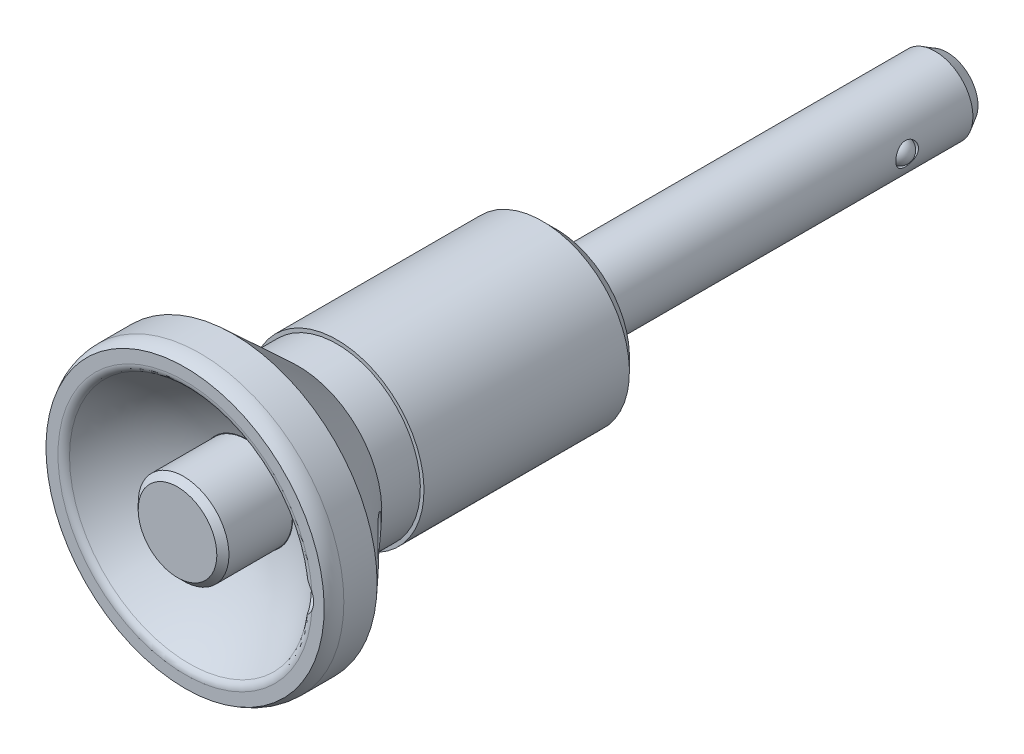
ISO-10303-21;
HEADER;
FILE_DESCRIPTION(('STEP AP214'),'2;1');
FILE_NAME('part.step','',(''),(''),'','','');
FILE_SCHEMA(('AUTOMOTIVE_DESIGN { 1 0 10303 214 1 1 1 1 }'));
ENDSEC;
DATA;
#1=APPLICATION_CONTEXT('core data for automotive mechanical design processes');
#2=APPLICATION_PROTOCOL_DEFINITION('international standard','automotive_design',2000,#1);
#3=PRODUCT_CONTEXT('',#1,'mechanical');
#4=PRODUCT('Part','Part','',(#3));
#5=PRODUCT_RELATED_PRODUCT_CATEGORY('part','',(#4));
#6=PRODUCT_DEFINITION_FORMATION('','',#4);
#7=PRODUCT_DEFINITION_CONTEXT('part definition',#1,'design');
#8=PRODUCT_DEFINITION('design','',#6,#7);
#9=PRODUCT_DEFINITION_SHAPE('','',#8);
#10=(LENGTH_UNIT() NAMED_UNIT(*) SI_UNIT(.MILLI.,.METRE.));
#11=(NAMED_UNIT(*) PLANE_ANGLE_UNIT() SI_UNIT($,.RADIAN.));
#12=(NAMED_UNIT(*) SI_UNIT($,.STERADIAN.) SOLID_ANGLE_UNIT());
#13=UNCERTAINTY_MEASURE_WITH_UNIT(LENGTH_MEASURE(1.E-05),#10,'distance_accuracy_value','');
#14=(GEOMETRIC_REPRESENTATION_CONTEXT(3) GLOBAL_UNCERTAINTY_ASSIGNED_CONTEXT((#13)) GLOBAL_UNIT_ASSIGNED_CONTEXT((#10,
#11,#12)) REPRESENTATION_CONTEXT('',''));
#15=CARTESIAN_POINT('',(0.,0.,0.));
#16=DIRECTION('',(0.,0.,1.));
#17=DIRECTION('',(1.,0.,0.));
#18=AXIS2_PLACEMENT_3D('',#15,#16,#17);
#19=CARTESIAN_POINT('',(0.,0.,-25.9));
#20=DIRECTION('',(0.,0.,-1.));
#21=DIRECTION('',(0.,1.,0.));
#22=AXIS2_PLACEMENT_3D('',#19,#20,#21);
#23=CYLINDRICAL_SURFACE('',#22,1.25);
#24=CARTESIAN_POINT('',(0.,0.,-25.9));
#25=DIRECTION('',(0.,0.,-1.));
#26=DIRECTION('',(0.,1.,0.));
#27=AXIS2_PLACEMENT_3D('',#24,#25,#26);
#28=CIRCLE('',#27,1.25);
#29=CARTESIAN_POINT('',(0.,1.25,-25.9));
#30=VERTEX_POINT('',#29);
#31=EDGE_CURVE('E137',#30,#30,#28,.T.);
#32=ORIENTED_EDGE('',*,*,#31,.T.);
#33=EDGE_LOOP('',(#32));
#34=FACE_BOUND('',#33,.T.);
#35=CARTESIAN_POINT('',(0.,0.,-21.9));
#36=DIRECTION('',(0.,0.,1.));
#37=DIRECTION('',(0.,-1.,0.));
#38=AXIS2_PLACEMENT_3D('',#35,#36,#37);
#39=CIRCLE('',#38,1.25);
#40=CARTESIAN_POINT('',(0.,-1.25,-21.9));
#41=VERTEX_POINT('',#40);
#42=EDGE_CURVE('E73',#41,#41,#39,.T.);
#43=ORIENTED_EDGE('',*,*,#42,.T.);
#44=EDGE_LOOP('',(#43));
#45=FACE_BOUND('',#44,.T.);
#46=ADVANCED_FACE('F14',(#34,#45),#23,.F.);
#47=CARTESIAN_POINT('',(3.5,0.,-20.75));
#48=DIRECTION('',(1.,0.,0.));
#49=DIRECTION('',(0.,1.,0.));
#50=AXIS2_PLACEMENT_3D('',#47,#48,#49);
#51=CYLINDRICAL_SURFACE('',#50,0.75);
#52=CARTESIAN_POINT('',(2.38484800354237,0.75,-20.75));
#53=CARTESIAN_POINT('',(2.38484842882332,0.749999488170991,-20.7910972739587));
#54=CARTESIAN_POINT('',(2.38592195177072,0.746610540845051,-20.8321996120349));
#55=CARTESIAN_POINT('',(2.39008289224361,0.733179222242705,-20.9132026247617));
#56=CARTESIAN_POINT('',(2.39317098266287,0.72313462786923,-20.9531028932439));
#57=CARTESIAN_POINT('',(2.40098051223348,0.696763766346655,-21.0305173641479));
#58=CARTESIAN_POINT('',(2.40569923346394,0.68044794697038,-21.0680354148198));
#59=CARTESIAN_POINT('',(2.41623466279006,0.642032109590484,-21.1398109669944));
#60=CARTESIAN_POINT('',(2.42205153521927,0.619931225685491,-21.1740679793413));
#61=CARTESIAN_POINT('',(2.43433431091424,0.569823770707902,-21.2394331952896));
#62=CARTESIAN_POINT('',(2.44081404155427,0.541666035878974,-21.2704229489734));
#63=CARTESIAN_POINT('',(2.4535743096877,0.480568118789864,-21.327318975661));
#64=CARTESIAN_POINT('',(2.45985482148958,0.447627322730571,-21.3532245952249));
#65=CARTESIAN_POINT('',(2.47166607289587,0.377055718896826,-21.3997313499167));
#66=CARTESIAN_POINT('',(2.47717862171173,0.339342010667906,-21.4202117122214));
#67=CARTESIAN_POINT('',(2.48667217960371,0.260812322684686,-21.4544936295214));
#68=CARTESIAN_POINT('',(2.49065351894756,0.219997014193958,-21.4682966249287));
#69=CARTESIAN_POINT('',(2.49653823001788,0.137661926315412,-21.4884400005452));
#70=CARTESIAN_POINT('',(2.49849778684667,0.0961956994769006,-21.4949825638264));
#71=CARTESIAN_POINT('',(2.50031600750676,0.0127109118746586,-21.5010586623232));
#72=CARTESIAN_POINT('',(2.5001751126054,-0.0293075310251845,-21.500593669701));
#73=CARTESIAN_POINT('',(2.49784801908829,-0.11128557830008,-21.4928035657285));
#74=CARTESIAN_POINT('',(2.49572710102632,-0.151268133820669,-21.4856974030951));
#75=CARTESIAN_POINT('',(2.48975761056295,-0.229444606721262,-21.4651843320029));
#76=CARTESIAN_POINT('',(2.48590892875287,-0.267638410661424,-21.4517770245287));
#77=CARTESIAN_POINT('',(2.47682610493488,-0.341673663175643,-21.4188939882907));
#78=CARTESIAN_POINT('',(2.47157634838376,-0.377482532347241,-21.3993493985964));
#79=CARTESIAN_POINT('',(2.46024820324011,-0.445382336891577,-21.3548010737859));
#80=CARTESIAN_POINT('',(2.45416961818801,-0.477472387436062,-21.3297960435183));
#81=CARTESIAN_POINT('',(2.44155775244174,-0.5383302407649,-21.2739011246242));
#82=CARTESIAN_POINT('',(2.43501597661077,-0.566922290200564,-21.2428215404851));
#83=CARTESIAN_POINT('',(2.42241989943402,-0.618538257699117,-21.176244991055));
#84=CARTESIAN_POINT('',(2.41636564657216,-0.641561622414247,-21.1407475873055));
#85=CARTESIAN_POINT('',(2.40538951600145,-0.681569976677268,-21.0658802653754));
#86=CARTESIAN_POINT('',(2.40047905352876,-0.698494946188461,-21.0264764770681));
#87=CARTESIAN_POINT('',(2.39248196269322,-0.725416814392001,-20.9451963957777));
#88=CARTESIAN_POINT('',(2.38939473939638,-0.735415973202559,-20.9033209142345));
#89=CARTESIAN_POINT('',(2.38552424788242,-0.747873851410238,-20.8199588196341));
#90=CARTESIAN_POINT('',(2.38465939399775,-0.75059973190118,-20.7785158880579));
#91=CARTESIAN_POINT('',(2.38510596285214,-0.749179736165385,-20.6957635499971));
#92=CARTESIAN_POINT('',(2.38641708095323,-0.745034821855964,-20.6544541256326));
#93=CARTESIAN_POINT('',(2.390987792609,-0.730228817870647,-20.5742558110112));
#94=CARTESIAN_POINT('',(2.39419588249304,-0.719739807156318,-20.5353319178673));
#95=CARTESIAN_POINT('',(2.40214570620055,-0.69274288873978,-20.4597991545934));
#96=CARTESIAN_POINT('',(2.40688767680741,-0.67623405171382,-20.42319064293));
#97=CARTESIAN_POINT('',(2.41752917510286,-0.637159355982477,-20.3522412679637));
#98=CARTESIAN_POINT('',(2.42345635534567,-0.614442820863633,-20.317987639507));
#99=CARTESIAN_POINT('',(2.43574102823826,-0.563776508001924,-20.2536809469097));
#100=CARTESIAN_POINT('',(2.44209862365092,-0.535825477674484,-20.2236288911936));
#101=CARTESIAN_POINT('',(2.45481816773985,-0.474227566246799,-20.1674097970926));
#102=CARTESIAN_POINT('',(2.46117122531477,-0.440405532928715,-20.1414321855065));
#103=CARTESIAN_POINT('',(2.4729242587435,-0.368730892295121,-20.0955166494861));
#104=CARTESIAN_POINT('',(2.47832428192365,-0.330878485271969,-20.0755784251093));
#105=CARTESIAN_POINT('',(2.48752985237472,-0.25246775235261,-20.0424999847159));
#106=CARTESIAN_POINT('',(2.49134726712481,-0.21193231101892,-20.0293089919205));
#107=CARTESIAN_POINT('',(2.49700989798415,-0.129084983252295,-20.0099695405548));
#108=CARTESIAN_POINT('',(2.4988556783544,-0.0867736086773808,-20.0038190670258));
#109=CARTESIAN_POINT('',(2.50033272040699,-0.00332607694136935,-19.9988884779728));
#110=CARTESIAN_POINT('',(2.50004652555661,0.0377925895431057,-19.9998336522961));
#111=CARTESIAN_POINT('',(2.49748632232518,0.119259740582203,-20.0084108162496));
#112=CARTESIAN_POINT('',(2.49521242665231,0.159608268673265,-20.0160424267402));
#113=CARTESIAN_POINT('',(2.48895584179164,0.23796790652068,-20.0376058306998));
#114=CARTESIAN_POINT('',(2.48499176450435,0.275999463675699,-20.0514690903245));
#115=CARTESIAN_POINT('',(2.47576471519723,0.349216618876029,-20.0850409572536));
#116=CARTESIAN_POINT('',(2.47050152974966,0.38440174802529,-20.1047505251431));
#117=CARTESIAN_POINT('',(2.45901982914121,0.45215094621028,-20.150186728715));
#118=CARTESIAN_POINT('',(2.45277613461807,0.484595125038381,-20.1760857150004));
#119=CARTESIAN_POINT('',(2.44011768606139,0.544768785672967,-20.2328551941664));
#120=CARTESIAN_POINT('',(2.43370288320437,0.572496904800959,-20.2637271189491));
#121=CARTESIAN_POINT('',(2.42120340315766,0.623281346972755,-20.3306703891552));
#122=CARTESIAN_POINT('',(2.41513426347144,0.646173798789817,-20.3668692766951));
#123=CARTESIAN_POINT('',(2.40426273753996,0.685521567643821,-20.4427775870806));
#124=CARTESIAN_POINT('',(2.3994597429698,0.70197997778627,-20.4824853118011));
#125=CARTESIAN_POINT('',(2.39213908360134,0.726509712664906,-20.5598702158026));
#126=CARTESIAN_POINT('',(2.38943077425,0.735294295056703,-20.5973043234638));
#127=CARTESIAN_POINT('',(2.38578521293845,0.747039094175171,-20.6731576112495));
#128=CARTESIAN_POINT('',(2.38484760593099,0.750000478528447,-20.7115765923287));
#129=CARTESIAN_POINT('',(2.38484800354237,0.75,-20.75));
#130=B_SPLINE_CURVE_WITH_KNOTS('',3,(#52,#53,#54,#55,#56,#57,#58,#59,#60,#61,#62,#63,#64,#65,
#66,#67,#68,#69,#70,#71,#72,#73,#74,#75,#76,#77,#78,#79,#80,#81,#82,#83,#84,#85,#86,#87,#88,#89,
#90,#91,#92,#93,#94,#95,#96,#97,#98,#99,#100,#101,#102,#103,#104,#105,#106,#107,#108,#109,#110,
#111,#112,#113,#114,#115,#116,#117,#118,#119,#120,#121,#122,#123,#124,#125,#126,#127,#128,#129),
.UNSPECIFIED.,.T.,.F.,(4,2,2,2,2,2,2,2,2,2,2,2,2,2,2,2,2,2,2,2,2,2,2,2,2,2,2,2,2,2,2,2,2,2,2,2,
2,2,4),(0.,0.12315008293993,0.246341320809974,0.369328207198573,0.492333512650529,
0.618865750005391,0.745414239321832,0.874579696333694,1.00371727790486,1.12916070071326,
1.25457777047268,1.37600062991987,1.49743117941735,1.62027604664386,1.74315008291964,
1.87076073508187,1.99838406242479,2.12723119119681,2.25603625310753,2.38004040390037,
2.50402719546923,2.62479297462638,2.74557740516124,2.86960365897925,2.99365962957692,
3.12239753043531,3.2511290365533,3.37887695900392,3.5065883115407,3.62938151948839,
3.75216776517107,3.87363548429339,3.99512317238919,4.12049813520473,4.24590926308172,
4.375058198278,4.50414496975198,4.61930576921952,4.73444347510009),.UNSPECIFIED.);
#131=CARTESIAN_POINT('',(2.38484800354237,0.75,-20.75));
#132=VERTEX_POINT('',#131);
#133=EDGE_CURVE('E467',#132,#132,#130,.T.);
#134=ORIENTED_EDGE('',*,*,#133,.F.);
#135=EDGE_LOOP('',(#134));
#136=FACE_BOUND('',#135,.T.);
#137=CARTESIAN_POINT('',(2.12206555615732,0.,-21.5));
#138=CARTESIAN_POINT('',(2.12206552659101,0.0420016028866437,-21.4999980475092));
#139=CARTESIAN_POINT('',(2.12177655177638,0.0840371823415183,-21.4964593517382));
#140=CARTESIAN_POINT('',(2.12061587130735,0.166953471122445,-21.4823928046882));
#141=CARTESIAN_POINT('',(2.11974338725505,0.207832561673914,-21.4718556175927));
#142=CARTESIAN_POINT('',(2.11740251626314,0.28721580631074,-21.444098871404));
#143=CARTESIAN_POINT('',(2.11593446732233,0.325721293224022,-21.4268831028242));
#144=CARTESIAN_POINT('',(2.11237724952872,0.399276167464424,-21.3862728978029));
#145=CARTESIAN_POINT('',(2.11028825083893,0.434326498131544,-21.3628801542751));
#146=CARTESIAN_POINT('',(2.10543833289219,0.50002756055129,-21.3105688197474));
#147=CARTESIAN_POINT('',(2.10267678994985,0.530674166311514,-21.2816451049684));
#148=CARTESIAN_POINT('',(2.09639815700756,0.586669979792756,-21.219125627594));
#149=CARTESIAN_POINT('',(2.092881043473,0.612019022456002,-21.1855297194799));
#150=CARTESIAN_POINT('',(2.08489768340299,0.65675554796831,-21.1146022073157));
#151=CARTESIAN_POINT('',(2.0804297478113,0.676132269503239,-21.0772640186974));
#152=CARTESIAN_POINT('',(2.07020296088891,0.708344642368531,-20.999991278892));
#153=CARTESIAN_POINT('',(2.0644438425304,0.721178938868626,-20.9600561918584));
#154=CARTESIAN_POINT('',(2.05389778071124,0.735194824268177,-20.8996910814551));
#155=CARTESIAN_POINT('',(2.05010571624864,0.738983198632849,-20.8796691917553));
#156=CARTESIAN_POINT('',(2.04141297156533,0.74488576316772,-20.8397229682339));
#157=CARTESIAN_POINT('',(2.03651754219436,0.747007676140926,-20.8197986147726));
#158=CARTESIAN_POINT('',(2.02684555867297,0.748972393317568,-20.790414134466));
#159=CARTESIAN_POINT('',(2.02323558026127,0.749424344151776,-20.7807072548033));
#160=CARTESIAN_POINT('',(2.01701848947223,0.74975233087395,-20.7694169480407));
#161=CARTESIAN_POINT('',(2.0156749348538,0.749806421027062,-20.767179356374));
#162=CARTESIAN_POINT('',(2.01268052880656,0.749891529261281,-20.7629215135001));
#163=CARTESIAN_POINT('',(2.01103259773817,0.749922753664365,-20.7608994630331));
#164=CARTESIAN_POINT('',(2.0084776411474,0.74995123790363,-20.758574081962));
#165=CARTESIAN_POINT('',(2.00780452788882,0.74995728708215,-20.7580205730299));
#166=CARTESIAN_POINT('',(2.00638639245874,0.749967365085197,-20.7570139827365));
#167=CARTESIAN_POINT('',(2.00564151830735,0.749971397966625,-20.7565607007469));
#168=CARTESIAN_POINT('',(2.00429958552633,0.74997677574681,-20.7559086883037));
#169=CARTESIAN_POINT('',(2.00372014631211,0.749978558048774,-20.7556742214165));
#170=CARTESIAN_POINT('',(2.00253072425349,0.74998127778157,-20.7553026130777));
#171=CARTESIAN_POINT('',(2.00192078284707,0.749982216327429,-20.755165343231));
#172=CARTESIAN_POINT('',(2.00068118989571,0.749983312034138,-20.7550039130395));
#173=CARTESIAN_POINT('',(2.0000514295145,0.749983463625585,-20.754980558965));
#174=CARTESIAN_POINT('',(1.99879872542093,0.749982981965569,-20.7550524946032));
#175=CARTESIAN_POINT('',(1.99817578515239,0.749982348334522,-20.7551478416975));
#176=CARTESIAN_POINT('',(1.99687877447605,0.74998011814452,-20.7554634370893));
#177=CARTESIAN_POINT('',(1.99620827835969,0.749978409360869,-20.7556980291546));
#178=CARTESIAN_POINT('',(1.99491412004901,0.749973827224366,-20.7562722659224));
#179=CARTESIAN_POINT('',(1.99429055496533,0.749970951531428,-20.7566121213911));
#180=CARTESIAN_POINT('',(1.99269674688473,0.749961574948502,-20.757617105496));
#181=CARTESIAN_POINT('',(1.99176918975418,0.749953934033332,-20.7583489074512));
#182=CARTESIAN_POINT('',(1.99002713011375,0.749934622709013,-20.759935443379));
#183=CARTESIAN_POINT('',(1.98921298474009,0.74992293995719,-20.7607905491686));
#184=CARTESIAN_POINT('',(1.9861138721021,0.749867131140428,-20.7643633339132));
#185=CARTESIAN_POINT('',(1.98416699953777,0.749805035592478,-20.767365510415));
#186=CARTESIAN_POINT('',(1.98064972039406,0.749635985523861,-20.7735811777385));
#187=CARTESIAN_POINT('',(1.97908220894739,0.749528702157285,-20.776796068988));
#188=CARTESIAN_POINT('',(1.97118573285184,0.748823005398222,-20.7943323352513));
#189=CARTESIAN_POINT('',(1.96669087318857,0.747791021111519,-20.8094291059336));
#190=CARTESIAN_POINT('',(1.95870745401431,0.744776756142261,-20.8397066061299));
#191=CARTESIAN_POINT('',(1.95522081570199,0.742792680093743,-20.8548874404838));
#192=CARTESIAN_POINT('',(1.94374396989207,0.733930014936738,-20.9094467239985));
#193=CARTESIAN_POINT('',(1.93743955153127,0.724291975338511,-20.9488040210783));
#194=CARTESIAN_POINT('',(1.92627183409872,0.698725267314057,-21.0255607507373));
#195=CARTESIAN_POINT('',(1.92140902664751,0.682794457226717,-21.0629595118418));
#196=CARTESIAN_POINT('',(1.91269378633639,0.644884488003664,-21.1350867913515));
#197=CARTESIAN_POINT('',(1.90884957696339,0.622858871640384,-21.169792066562));
#198=CARTESIAN_POINT('',(1.9019443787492,0.573395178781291,-21.2351809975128));
#199=CARTESIAN_POINT('',(1.89888335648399,0.545957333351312,-21.2658648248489));
#200=CARTESIAN_POINT('',(1.89337289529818,0.48565239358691,-21.3230715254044));
#201=CARTESIAN_POINT('',(1.89094062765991,0.452666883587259,-21.3494714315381));
#202=CARTESIAN_POINT('',(1.88672141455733,0.382705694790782,-21.3963827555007));
#203=CARTESIAN_POINT('',(1.88493451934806,0.345729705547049,-21.4168937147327));
#204=CARTESIAN_POINT('',(1.88197364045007,0.268898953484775,-21.4514014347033));
#205=CARTESIAN_POINT('',(1.88079872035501,0.229048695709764,-21.4654081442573));
#206=CARTESIAN_POINT('',(1.87903847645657,0.147552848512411,-21.4865461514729));
#207=CARTESIAN_POINT('',(1.87845313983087,0.105907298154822,-21.4936775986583));
#208=CARTESIAN_POINT('',(1.87786418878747,0.0220644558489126,-21.5008535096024));
#209=CARTESIAN_POINT('',(1.87785976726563,-0.0201319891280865,-21.5009078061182));
#210=CARTESIAN_POINT('',(1.87843054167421,-0.103934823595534,-21.4939525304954));
#211=CARTESIAN_POINT('',(1.87900573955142,-0.145541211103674,-21.4869429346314));
#212=CARTESIAN_POINT('',(1.88074362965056,-0.226969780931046,-21.4660662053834));
#213=CARTESIAN_POINT('',(1.88190614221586,-0.266792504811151,-21.4522011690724));
#214=CARTESIAN_POINT('',(1.88483707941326,-0.343537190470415,-21.4180169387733));
#215=CARTESIAN_POINT('',(1.88660547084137,-0.38045931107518,-21.3976980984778));
#216=CARTESIAN_POINT('',(1.89078474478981,-0.450386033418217,-21.3511798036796));
#217=CARTESIAN_POINT('',(1.89319605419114,-0.483388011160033,-21.3249764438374));
#218=CARTESIAN_POINT('',(1.89872480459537,-0.544528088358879,-21.2674467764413));
#219=CARTESIAN_POINT('',(1.90184247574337,-0.572664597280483,-21.2361188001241));
#220=CARTESIAN_POINT('',(1.90891559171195,-0.623332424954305,-21.1691939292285));
#221=CARTESIAN_POINT('',(1.91287294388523,-0.64585072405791,-21.1335873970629));
#222=CARTESIAN_POINT('',(1.92185974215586,-0.684556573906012,-21.059244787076));
#223=CARTESIAN_POINT('',(1.92688769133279,-0.700752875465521,-21.0205131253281));
#224=CARTESIAN_POINT('',(1.93569998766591,-0.719912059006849,-20.9613088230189));
#225=CARTESIAN_POINT('',(1.93882374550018,-0.725422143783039,-20.9415275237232));
#226=CARTESIAN_POINT('',(1.94572571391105,-0.734783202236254,-20.9016930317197));
#227=CARTESIAN_POINT('',(1.94950340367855,-0.738635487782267,-20.8816400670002));
#228=CARTESIAN_POINT('',(1.95814565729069,-0.744662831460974,-20.8415775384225));
#229=CARTESIAN_POINT('',(1.96300736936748,-0.746842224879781,-20.8215679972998));
#230=CARTESIAN_POINT('',(1.97256849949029,-0.748884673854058,-20.7920280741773));
#231=CARTESIAN_POINT('',(1.97613548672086,-0.749360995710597,-20.7822567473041));
#232=CARTESIAN_POINT('',(1.98218536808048,-0.749715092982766,-20.7708069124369));
#233=CARTESIAN_POINT('',(1.98348487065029,-0.749774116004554,-20.7685398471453));
#234=CARTESIAN_POINT('',(1.98636386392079,-0.74986881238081,-20.7641876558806));
#235=CARTESIAN_POINT('',(1.98794184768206,-0.749904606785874,-20.7621016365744));
#236=CARTESIAN_POINT('',(1.99047765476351,-0.749940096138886,-20.759509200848));
#237=CARTESIAN_POINT('',(1.99123387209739,-0.749948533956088,-20.7588100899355));
#238=CARTESIAN_POINT('',(1.99284087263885,-0.749962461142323,-20.7575302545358));
#239=CARTESIAN_POINT('',(1.99369132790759,-0.74996796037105,-20.7569491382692));
#240=CARTESIAN_POINT('',(1.99514970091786,-0.749974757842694,-20.7561608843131));
#241=CARTESIAN_POINT('',(1.99572587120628,-0.749976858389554,-20.7558957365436));
#242=CARTESIAN_POINT('',(1.99691288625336,-0.749980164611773,-20.7554589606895));
#243=CARTESIAN_POINT('',(1.99752368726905,-0.74998137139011,-20.7552872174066));
#244=CARTESIAN_POINT('',(1.99877257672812,-0.749982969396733,-20.755055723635));
#245=CARTESIAN_POINT('',(1.99941086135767,-0.749983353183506,-20.7549969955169));
#246=CARTESIAN_POINT('',(2.00068685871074,-0.749983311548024,-20.7550032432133));
#247=CARTESIAN_POINT('',(2.0013245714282,-0.749982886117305,-20.7550682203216));
#248=CARTESIAN_POINT('',(2.00250998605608,-0.749981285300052,-20.7552992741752));
#249=CARTESIAN_POINT('',(2.00306003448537,-0.749980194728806,-20.7554538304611));
#250=CARTESIAN_POINT('',(2.00413225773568,-0.749977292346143,-20.7558393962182));
#251=CARTESIAN_POINT('',(2.00465441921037,-0.749975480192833,-20.7560704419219));
#252=CARTESIAN_POINT('',(2.00604384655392,-0.749969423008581,-20.7567872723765));
#253=CARTESIAN_POINT('',(2.00687904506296,-0.749964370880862,-20.7573347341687));
#254=CARTESIAN_POINT('',(2.00845949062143,-0.749951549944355,-20.7585470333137));
#255=CARTESIAN_POINT('',(2.00920439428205,-0.749943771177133,-20.7592122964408));
#256=CARTESIAN_POINT('',(2.01179340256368,-0.749909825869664,-20.7617738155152));
#257=CARTESIAN_POINT('',(2.01341810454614,-0.749874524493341,-20.7638864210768));
#258=CARTESIAN_POINT('',(2.01637599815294,-0.749779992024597,-20.7683057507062));
#259=CARTESIAN_POINT('',(2.01770709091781,-0.749720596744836,-20.7706137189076));
#260=CARTESIAN_POINT('',(2.02386184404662,-0.749364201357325,-20.782208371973));
#261=CARTESIAN_POINT('',(2.02747600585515,-0.748881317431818,-20.7921055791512));
#262=CARTESIAN_POINT('',(2.03390293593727,-0.747496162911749,-20.812079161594));
#263=CARTESIAN_POINT('',(2.03671325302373,-0.746592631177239,-20.8221559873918));
#264=CARTESIAN_POINT('',(2.04854756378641,-0.741498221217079,-20.8682211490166));
#265=CARTESIAN_POINT('',(2.05509857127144,-0.734806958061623,-20.9046218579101));
#266=CARTESIAN_POINT('',(2.06668346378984,-0.716059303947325,-20.9761498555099));
#267=CARTESIAN_POINT('',(2.07171700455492,-0.704001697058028,-21.0112768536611));
#268=CARTESIAN_POINT('',(2.08068762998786,-0.674801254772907,-21.0794028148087));
#269=CARTESIAN_POINT('',(2.08462795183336,-0.65767375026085,-21.1124078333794));
#270=CARTESIAN_POINT('',(2.09177764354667,-0.618687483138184,-21.1755655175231));
#271=CARTESIAN_POINT('',(2.09498703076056,-0.596828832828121,-21.2057182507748));
#272=CARTESIAN_POINT('',(2.10116735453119,-0.545719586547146,-21.2661901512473));
#273=CARTESIAN_POINT('',(2.10405302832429,-0.515877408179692,-21.2960211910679));
#274=CARTESIAN_POINT('',(2.10914374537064,-0.451566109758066,-21.3503003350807));
#275=CARTESIAN_POINT('',(2.11134835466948,-0.417094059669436,-21.3747450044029));
#276=CARTESIAN_POINT('',(2.11512569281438,-0.344521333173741,-21.4175173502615));
#277=CARTESIAN_POINT('',(2.11669850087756,-0.306421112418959,-21.4358457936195));
#278=CARTESIAN_POINT('',(2.11924053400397,-0.227705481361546,-21.4658349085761));
#279=CARTESIAN_POINT('',(2.12021060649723,-0.187093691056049,-21.477504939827));
#280=CARTESIAN_POINT('',(2.12128084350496,-0.121823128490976,-21.4904453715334));
#281=CARTESIAN_POINT('',(2.12157516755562,-0.0976020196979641,-21.494024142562));
#282=CARTESIAN_POINT('',(2.12196753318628,-0.0489244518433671,-21.4988020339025));
#283=CARTESIAN_POINT('',(2.12206557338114,-0.0244679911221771,-21.5000011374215));
#284=CARTESIAN_POINT('',(2.12206555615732,0.,-21.5));
#285=B_SPLINE_CURVE_WITH_KNOTS('',3,(#137,#138,#139,#140,#141,#142,#143,#144,#145,#146,#147,
#148,#149,#150,#151,#152,#153,#154,#155,#156,#157,#158,#159,#160,#161,#162,#163,#164,#165,#166,
#167,#168,#169,#170,#171,#172,#173,#174,#175,#176,#177,#178,#179,#180,#181,#182,#183,#184,#185,
#186,#187,#188,#189,#190,#191,#192,#193,#194,#195,#196,#197,#198,#199,#200,#201,#202,#203,#204,
#205,#206,#207,#208,#209,#210,#211,#212,#213,#214,#215,#216,#217,#218,#219,#220,#221,#222,#223,
#224,#225,#226,#227,#228,#229,#230,#231,#232,#233,#234,#235,#236,#237,#238,#239,#240,#241,#242,
#243,#244,#245,#246,#247,#248,#249,#250,#251,#252,#253,#254,#255,#256,#257,#258,#259,#260,#261,
#262,#263,#264,#265,#266,#267,#268,#269,#270,#271,#272,#273,#274,#275,#276,#277,#278,#279,#280,
#281,#282,#283,#284),.UNSPECIFIED.,.T.,.F.,(4,2,2,2,2,2,2,2,2,2,2,2,2,2,2,2,2,2,2,2,2,2,2,2,2,2,
2,2,2,2,2,2,2,2,2,2,2,2,2,2,2,2,2,2,2,2,2,2,2,2,2,2,2,2,2,2,2,2,2,2,2,2,2,2,2,2,2,2,2,2,2,2,2,
4),(0.,0.125915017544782,0.251998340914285,0.378010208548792,0.503987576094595,
0.630082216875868,0.75618078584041,0.882505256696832,1.00885587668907,1.07095509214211,
1.13276479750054,1.16364176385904,1.17146560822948,1.17921795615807,1.18182645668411,
1.18442968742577,1.18629815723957,1.18816415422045,1.19004333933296,1.19192343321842,
1.19404265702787,1.19616615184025,1.19969056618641,1.20322583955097,1.21387723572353,
1.22460752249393,1.27164281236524,1.3187671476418,1.44104687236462,1.56336824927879,
1.68664899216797,1.80992447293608,1.93627677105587,2.06263890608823,2.18880711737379,
2.31497258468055,2.44096276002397,2.56695335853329,2.69290544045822,2.81885062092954,
2.94487963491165,3.07094977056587,3.19730940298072,3.32349350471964,3.38574594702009,
3.44794903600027,3.5099903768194,3.54103548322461,3.54886944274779,3.55666224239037,
3.55974510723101,3.56281756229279,3.56471411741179,3.5666083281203,3.56851959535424,
3.57043088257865,3.5721383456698,3.57384661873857,3.57682501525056,3.5798144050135,
3.58774744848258,3.59573548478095,3.62715703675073,3.65867340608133,3.77072612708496,
3.88280425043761,3.9945468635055,4.10628682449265,4.23255563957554,4.35890474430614,
4.48523800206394,4.61139323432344,4.68474438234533,4.75809604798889),.UNSPECIFIED.);
#286=CARTESIAN_POINT('',(1.98517452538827,-0.749829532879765,-20.7659897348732));
#287=VERTEX_POINT('',#286);
#288=CARTESIAN_POINT('',(1.98517452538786,0.749829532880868,-20.7659897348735));
#289=VERTEX_POINT('',#288);
#290=EDGE_CURVE('E32',#287,#289,#285,.T.);
#291=ORIENTED_EDGE('',*,*,#290,.F.);
#292=CARTESIAN_POINT('',(1.98511012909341,0.75,-20.75));
#293=CARTESIAN_POINT('',(1.98510947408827,0.750000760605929,-20.7906891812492));
#294=CARTESIAN_POINT('',(1.98637478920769,0.746677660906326,-20.8313730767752));
#295=CARTESIAN_POINT('',(1.99126881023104,0.733525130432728,-20.9115254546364));
#296=CARTESIAN_POINT('',(1.99489767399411,0.723695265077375,-20.9509938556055));
#297=CARTESIAN_POINT('',(2.00405749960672,0.697925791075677,-21.027538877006));
#298=CARTESIAN_POINT('',(2.00958434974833,0.681999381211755,-21.0646204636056));
#299=CARTESIAN_POINT('',(2.02191113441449,0.644534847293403,-21.1355987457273));
#300=CARTESIAN_POINT('',(2.02871140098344,0.622995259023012,-21.1694946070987));
#301=CARTESIAN_POINT('',(2.04315464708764,0.573899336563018,-21.2346325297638));
#302=CARTESIAN_POINT('',(2.05082046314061,0.546136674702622,-21.2657140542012));
#303=CARTESIAN_POINT('',(2.06593925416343,0.485821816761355,-21.3228913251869));
#304=CARTESIAN_POINT('',(2.07339218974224,0.45326874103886,-21.3489861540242));
#305=CARTESIAN_POINT('',(2.08751316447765,0.383102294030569,-21.396198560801));
#306=CARTESIAN_POINT('',(2.09415125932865,0.345367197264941,-21.4171449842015));
#307=CARTESIAN_POINT('',(2.10562302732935,0.266633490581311,-21.4523276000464));
#308=CARTESIAN_POINT('',(2.11045725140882,0.225635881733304,-21.4665658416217));
#309=CARTESIAN_POINT('',(2.11761468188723,0.143226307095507,-21.4873748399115));
#310=CARTESIAN_POINT('',(2.12002790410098,0.101891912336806,-21.4942212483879));
#311=CARTESIAN_POINT('',(2.12239260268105,0.0185951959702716,-21.5009318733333));
#312=CARTESIAN_POINT('',(2.12234479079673,-0.0233669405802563,-21.5007981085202));
#313=CARTESIAN_POINT('',(2.1198520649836,-0.104765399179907,-21.4937203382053));
#314=CARTESIAN_POINT('',(2.11751277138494,-0.144231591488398,-21.4870763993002));
#315=CARTESIAN_POINT('',(2.11083531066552,-0.221447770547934,-21.4676670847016));
#316=CARTESIAN_POINT('',(2.10649700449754,-0.259197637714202,-21.4549012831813));
#317=CARTESIAN_POINT('',(2.09618170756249,-0.332529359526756,-21.4234526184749));
#318=CARTESIAN_POINT('',(2.09018277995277,-0.368073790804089,-21.4046899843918));
#319=CARTESIAN_POINT('',(2.07716261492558,-0.435593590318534,-21.3618481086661));
#320=CARTESIAN_POINT('',(2.07014107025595,-0.467567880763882,-21.3377672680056));
#321=CARTESIAN_POINT('',(2.05537310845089,-0.528817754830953,-21.2834909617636));
#322=CARTESIAN_POINT('',(2.04760798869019,-0.557863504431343,-21.2530408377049));
#323=CARTESIAN_POINT('',(2.03253136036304,-0.610516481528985,-21.187644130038));
#324=CARTESIAN_POINT('',(2.02521994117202,-0.634122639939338,-21.1526966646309));
#325=CARTESIAN_POINT('',(2.01176867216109,-0.675599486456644,-21.0784862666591));
#326=CARTESIAN_POINT('',(2.00565194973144,-0.693360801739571,-21.0391576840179));
#327=CARTESIAN_POINT('',(1.99554932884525,-0.721926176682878,-20.9577958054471));
#328=CARTESIAN_POINT('',(1.99156240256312,-0.732733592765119,-20.9157638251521));
#329=CARTESIAN_POINT('',(1.98640793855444,-0.746590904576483,-20.8324370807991));
#330=CARTESIAN_POINT('',(1.98510948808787,-0.750001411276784,-20.7912104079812));
#331=CARTESIAN_POINT('',(1.98511077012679,-0.749998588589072,-20.7087622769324));
#332=CARTESIAN_POINT('',(1.98640995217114,-0.746586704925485,-20.6675408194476));
#333=CARTESIAN_POINT('',(1.99132841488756,-0.73336148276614,-20.5880087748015));
#334=CARTESIAN_POINT('',(1.99485212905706,-0.723811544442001,-20.5496478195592));
#335=CARTESIAN_POINT('',(2.00371360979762,-0.698904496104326,-20.4750848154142));
#336=CARTESIAN_POINT('',(2.00905172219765,-0.68354627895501,-20.4388831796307));
#337=CARTESIAN_POINT('',(2.02116838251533,-0.646857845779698,-20.3682772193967));
#338=CARTESIAN_POINT('',(2.02799034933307,-0.625339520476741,-20.3339783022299));
#339=CARTESIAN_POINT('',(2.0422272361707,-0.577148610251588,-20.2693487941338));
#340=CARTESIAN_POINT('',(2.049642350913,-0.550474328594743,-20.2390195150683));
#341=CARTESIAN_POINT('',(2.06472450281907,-0.49098465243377,-20.1814583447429));
#342=CARTESIAN_POINT('',(2.07238288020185,-0.457911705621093,-20.1544895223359));
#343=CARTESIAN_POINT('',(2.08669071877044,-0.387520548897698,-20.1064607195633));
#344=CARTESIAN_POINT('',(2.09334020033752,-0.350202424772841,-20.085400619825));
#345=CARTESIAN_POINT('',(2.10486052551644,-0.272501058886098,-20.04996007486));
#346=CARTESIAN_POINT('',(2.10974080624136,-0.232135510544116,-20.0355440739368));
#347=CARTESIAN_POINT('',(2.1172111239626,-0.149343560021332,-20.0137754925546));
#348=CARTESIAN_POINT('',(2.11980210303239,-0.106918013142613,-20.0064200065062));
#349=CARTESIAN_POINT('',(2.1223221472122,-0.0236025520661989,-19.9992676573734));
#350=CARTESIAN_POINT('',(2.12238350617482,0.0172514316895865,-19.9990951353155));
#351=CARTESIAN_POINT('',(2.12017213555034,0.0983795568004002,-20.0053683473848));
#352=CARTESIAN_POINT('',(2.11789963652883,0.138653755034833,-20.0118134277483));
#353=CARTESIAN_POINT('',(2.11133034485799,0.216681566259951,-20.0308817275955));
#354=CARTESIAN_POINT('',(2.10707427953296,0.254469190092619,-20.0433808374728));
#355=CARTESIAN_POINT('',(2.09697770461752,0.327420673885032,-20.0740837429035));
#356=CARTESIAN_POINT('',(2.09113689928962,0.362584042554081,-20.0922886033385));
#357=CARTESIAN_POINT('',(2.07817677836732,0.430810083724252,-20.1347117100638));
#358=CARTESIAN_POINT('',(2.07101599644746,0.463734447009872,-20.1591395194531));
#359=CARTESIAN_POINT('',(2.05630552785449,0.525136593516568,-20.2129712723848));
#360=CARTESIAN_POINT('',(2.04875571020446,0.553612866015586,-20.2423768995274));
#361=CARTESIAN_POINT('',(2.03370376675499,0.606635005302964,-20.3069242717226));
#362=CARTESIAN_POINT('',(2.02621942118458,0.63094326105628,-20.3422660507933));
#363=CARTESIAN_POINT('',(2.01255226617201,0.673269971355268,-20.4167698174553));
#364=CARTESIAN_POINT('',(2.00636932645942,0.691289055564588,-20.4559314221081));
#365=CARTESIAN_POINT('',(1.996117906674,0.720357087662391,-20.5368652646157));
#366=CARTESIAN_POINT('',(1.9920414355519,0.73143241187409,-20.5786269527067));
#367=CARTESIAN_POINT('',(1.98653852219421,0.746251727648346,-20.6635948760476));
#368=CARTESIAN_POINT('',(1.98511082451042,0.749999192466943,-20.706800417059));
#369=CARTESIAN_POINT('',(1.98511012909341,0.75,-20.75));
#370=B_SPLINE_CURVE_WITH_KNOTS('',3,(#292,#293,#294,#295,#296,#297,#298,#299,#300,#301,#302,
#303,#304,#305,#306,#307,#308,#309,#310,#311,#312,#313,#314,#315,#316,#317,#318,#319,#320,#321,
#322,#323,#324,#325,#326,#327,#328,#329,#330,#331,#332,#333,#334,#335,#336,#337,#338,#339,#340,
#341,#342,#343,#344,#345,#346,#347,#348,#349,#350,#351,#352,#353,#354,#355,#356,#357,#358,#359,
#360,#361,#362,#363,#364,#365,#366,#367,#368,#369),.UNSPECIFIED.,.T.,.F.,(4,2,2,2,2,2,2,2,2,2,2,
2,2,2,2,2,2,2,2,2,2,2,2,2,2,2,2,2,2,2,2,2,2,2,2,2,2,2,4),(0.,0.121907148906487,
0.243822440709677,0.365475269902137,0.487159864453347,0.613715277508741,0.740293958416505,
0.87063807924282,1.00094235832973,1.1261990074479,1.25141943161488,1.3711272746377,
1.49084344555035,1.61222346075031,1.73364002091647,1.86143140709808,1.98924788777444,
2.11933565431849,2.24936058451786,2.37288906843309,2.49639137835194,2.61491875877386,
2.73346874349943,2.85611728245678,2.97880625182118,3.10826153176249,3.23771419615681,
3.36646581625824,3.49516442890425,3.61712333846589,3.73907020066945,3.85861662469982,
3.97818537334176,4.10248855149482,4.22683385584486,4.35683352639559,4.48682017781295,
4.61631002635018,4.7457384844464),.UNSPECIFIED.);
#371=EDGE_CURVE('E68',#287,#289,#370,.T.);
#372=ORIENTED_EDGE('',*,*,#371,.T.);
#373=EDGE_LOOP('',(#291,#372));
#374=FACE_BOUND('',#373,.T.);
#375=ADVANCED_FACE('F72',(#136,#374),#51,.F.);
#376=CARTESIAN_POINT('',(-2.38484800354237,0.75,-20.75));
#377=CARTESIAN_POINT('',(-2.38484842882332,0.74999948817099,-20.7089027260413));
#378=CARTESIAN_POINT('',(-2.38592195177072,0.746610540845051,-20.6678003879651));
#379=CARTESIAN_POINT('',(-2.39008289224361,0.733179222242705,-20.5867973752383));
#380=CARTESIAN_POINT('',(-2.39317098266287,0.723134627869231,-20.5468971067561));
#381=CARTESIAN_POINT('',(-2.40098051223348,0.696763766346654,-20.4694826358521));
#382=CARTESIAN_POINT('',(-2.40569923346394,0.680447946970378,-20.4319645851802));
#383=CARTESIAN_POINT('',(-2.41623466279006,0.642032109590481,-20.3601890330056));
#384=CARTESIAN_POINT('',(-2.42205153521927,0.619931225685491,-20.3259320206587));
#385=CARTESIAN_POINT('',(-2.43433431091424,0.569823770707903,-20.2605668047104));
#386=CARTESIAN_POINT('',(-2.44081404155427,0.541666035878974,-20.2295770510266));
#387=CARTESIAN_POINT('',(-2.4535743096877,0.480568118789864,-20.172681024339));
#388=CARTESIAN_POINT('',(-2.45985482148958,0.447627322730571,-20.1467754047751));
#389=CARTESIAN_POINT('',(-2.47166607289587,0.377055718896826,-20.1002686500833));
#390=CARTESIAN_POINT('',(-2.47717862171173,0.339342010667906,-20.0797882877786));
#391=CARTESIAN_POINT('',(-2.48667217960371,0.260812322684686,-20.0455063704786));
#392=CARTESIAN_POINT('',(-2.49065351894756,0.219997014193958,-20.0317033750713));
#393=CARTESIAN_POINT('',(-2.49653823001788,0.137661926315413,-20.0115599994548));
#394=CARTESIAN_POINT('',(-2.49849778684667,0.0961956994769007,-20.0050174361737));
#395=CARTESIAN_POINT('',(-2.50031600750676,0.0127109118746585,-19.9989413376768));
#396=CARTESIAN_POINT('',(-2.5001751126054,-0.0293075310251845,-19.999406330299));
#397=CARTESIAN_POINT('',(-2.49784801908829,-0.11128557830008,-20.0071964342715));
#398=CARTESIAN_POINT('',(-2.49572710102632,-0.15126813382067,-20.0143025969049));
#399=CARTESIAN_POINT('',(-2.48975761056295,-0.229444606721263,-20.0348156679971));
#400=CARTESIAN_POINT('',(-2.48590892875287,-0.267638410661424,-20.0482229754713));
#401=CARTESIAN_POINT('',(-2.47682610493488,-0.341673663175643,-20.0811060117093));
#402=CARTESIAN_POINT('',(-2.47157634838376,-0.377482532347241,-20.1006506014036));
#403=CARTESIAN_POINT('',(-2.46024820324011,-0.445382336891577,-20.1451989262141));
#404=CARTESIAN_POINT('',(-2.45416961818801,-0.477472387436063,-20.1702039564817));
#405=CARTESIAN_POINT('',(-2.44155775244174,-0.5383302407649,-20.2260988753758));
#406=CARTESIAN_POINT('',(-2.43501597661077,-0.566922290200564,-20.2571784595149));
#407=CARTESIAN_POINT('',(-2.42241989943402,-0.618538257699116,-20.323755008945));
#408=CARTESIAN_POINT('',(-2.41636564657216,-0.641561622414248,-20.3592524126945));
#409=CARTESIAN_POINT('',(-2.40538951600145,-0.68156997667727,-20.4341197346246));
#410=CARTESIAN_POINT('',(-2.40047905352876,-0.698494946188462,-20.4735235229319));
#411=CARTESIAN_POINT('',(-2.39248196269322,-0.725416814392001,-20.5548036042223));
#412=CARTESIAN_POINT('',(-2.38939473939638,-0.735415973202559,-20.5966790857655));
#413=CARTESIAN_POINT('',(-2.38552424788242,-0.747873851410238,-20.6800411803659));
#414=CARTESIAN_POINT('',(-2.38465939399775,-0.75059973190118,-20.7214841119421));
#415=CARTESIAN_POINT('',(-2.38510596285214,-0.749179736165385,-20.8042364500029));
#416=CARTESIAN_POINT('',(-2.38641708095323,-0.745034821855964,-20.8455458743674));
#417=CARTESIAN_POINT('',(-2.390987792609,-0.730228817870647,-20.9257441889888));
#418=CARTESIAN_POINT('',(-2.39419588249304,-0.719739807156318,-20.9646680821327));
#419=CARTESIAN_POINT('',(-2.40214570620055,-0.69274288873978,-21.0402008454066));
#420=CARTESIAN_POINT('',(-2.40688767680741,-0.67623405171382,-21.07680935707));
#421=CARTESIAN_POINT('',(-2.41752917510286,-0.637159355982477,-21.1477587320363));
#422=CARTESIAN_POINT('',(-2.42345635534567,-0.614442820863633,-21.182012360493));
#423=CARTESIAN_POINT('',(-2.43574102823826,-0.563776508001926,-21.2463190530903));
#424=CARTESIAN_POINT('',(-2.44209862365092,-0.535825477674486,-21.2763711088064));
#425=CARTESIAN_POINT('',(-2.45481816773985,-0.4742275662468,-21.3325902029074));
#426=CARTESIAN_POINT('',(-2.46117122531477,-0.440405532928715,-21.3585678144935));
#427=CARTESIAN_POINT('',(-2.4729242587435,-0.368730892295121,-21.4044833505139));
#428=CARTESIAN_POINT('',(-2.47832428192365,-0.330878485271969,-21.4244215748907));
#429=CARTESIAN_POINT('',(-2.48752985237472,-0.252467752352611,-21.4575000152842));
#430=CARTESIAN_POINT('',(-2.49134726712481,-0.21193231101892,-21.4706910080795));
#431=CARTESIAN_POINT('',(-2.49700989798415,-0.129084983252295,-21.4900304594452));
#432=CARTESIAN_POINT('',(-2.4988556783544,-0.0867736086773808,-21.4961809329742));
#433=CARTESIAN_POINT('',(-2.50033272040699,-0.00332607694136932,-21.5011115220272));
#434=CARTESIAN_POINT('',(-2.50004652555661,0.0377925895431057,-21.5001663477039));
#435=CARTESIAN_POINT('',(-2.49748632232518,0.119259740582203,-21.4915891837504));
#436=CARTESIAN_POINT('',(-2.49521242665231,0.159608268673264,-21.4839575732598));
#437=CARTESIAN_POINT('',(-2.48895584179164,0.23796790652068,-21.4623941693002));
#438=CARTESIAN_POINT('',(-2.48499176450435,0.2759994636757,-21.4485309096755));
#439=CARTESIAN_POINT('',(-2.47576471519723,0.349216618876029,-21.4149590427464));
#440=CARTESIAN_POINT('',(-2.47050152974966,0.384401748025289,-21.3952494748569));
#441=CARTESIAN_POINT('',(-2.45901982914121,0.452150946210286,-21.349813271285));
#442=CARTESIAN_POINT('',(-2.45277613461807,0.484595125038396,-21.3239142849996));
#443=CARTESIAN_POINT('',(-2.44011768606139,0.544768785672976,-21.2671448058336));
#444=CARTESIAN_POINT('',(-2.43370288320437,0.572496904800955,-21.2362728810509));
#445=CARTESIAN_POINT('',(-2.42120340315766,0.623281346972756,-21.1693296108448));
#446=CARTESIAN_POINT('',(-2.41513426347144,0.646173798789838,-21.1331307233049));
#447=CARTESIAN_POINT('',(-2.40426273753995,0.685521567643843,-21.0572224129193));
#448=CARTESIAN_POINT('',(-2.39945974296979,0.701979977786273,-21.0175146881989));
#449=CARTESIAN_POINT('',(-2.39213908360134,0.7265097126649,-20.9401297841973));
#450=CARTESIAN_POINT('',(-2.38943077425,0.735294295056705,-20.9026956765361));
#451=CARTESIAN_POINT('',(-2.38578521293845,0.747039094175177,-20.8268423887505));
#452=CARTESIAN_POINT('',(-2.38484760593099,0.750000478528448,-20.7884234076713));
#453=CARTESIAN_POINT('',(-2.38484800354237,0.75,-20.75));
#454=B_SPLINE_CURVE_WITH_KNOTS('',3,(#376,#377,#378,#379,#380,#381,#382,#383,#384,#385,#386,
#387,#388,#389,#390,#391,#392,#393,#394,#395,#396,#397,#398,#399,#400,#401,#402,#403,#404,#405,
#406,#407,#408,#409,#410,#411,#412,#413,#414,#415,#416,#417,#418,#419,#420,#421,#422,#423,#424,
#425,#426,#427,#428,#429,#430,#431,#432,#433,#434,#435,#436,#437,#438,#439,#440,#441,#442,#443,
#444,#445,#446,#447,#448,#449,#450,#451,#452,#453),.UNSPECIFIED.,.T.,.F.,(4,2,2,2,2,2,2,2,2,2,2,
2,2,2,2,2,2,2,2,2,2,2,2,2,2,2,2,2,2,2,2,2,2,2,2,2,2,2,4),(0.,0.12315008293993,0.246341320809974,
0.369328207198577,0.492333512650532,0.618865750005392,0.745414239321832,0.874579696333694,
1.00371727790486,1.12916070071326,1.25457777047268,1.37600062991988,1.49743117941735,
1.62027604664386,1.74315008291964,1.87076073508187,1.99838406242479,2.12723119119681,
2.25603625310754,2.38004040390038,2.50402719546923,2.62479297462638,2.74557740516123,
2.86960365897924,2.99365962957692,3.12239753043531,3.2511290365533,3.37887695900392,
3.5065883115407,3.62938151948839,3.75216776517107,3.87363548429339,3.99512317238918,
4.12049813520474,4.24590926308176,4.37505819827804,4.50414496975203,4.61930576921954,
4.73444347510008),.UNSPECIFIED.);
#455=CARTESIAN_POINT('',(-2.38484800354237,0.75,-20.75));
#456=VERTEX_POINT('',#455);
#457=EDGE_CURVE('E93',#456,#456,#454,.T.);
#458=ORIENTED_EDGE('',*,*,#457,.F.);
#459=EDGE_LOOP('',(#458));
#460=FACE_BOUND('',#459,.T.);
#461=CARTESIAN_POINT('',(-2.12206555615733,0.,-21.5));
#462=CARTESIAN_POINT('',(-2.12206552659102,-0.0420016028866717,-21.4999980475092));
#463=CARTESIAN_POINT('',(-2.12177655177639,-0.0840371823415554,-21.4964593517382));
#464=CARTESIAN_POINT('',(-2.12061587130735,-0.166953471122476,-21.4823928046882));
#465=CARTESIAN_POINT('',(-2.11974338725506,-0.20783256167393,-21.4718556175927));
#466=CARTESIAN_POINT('',(-2.11740251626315,-0.287215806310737,-21.444098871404));
#467=CARTESIAN_POINT('',(-2.11593446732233,-0.325721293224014,-21.4268831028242));
#468=CARTESIAN_POINT('',(-2.11237724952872,-0.399276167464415,-21.3862728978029));
#469=CARTESIAN_POINT('',(-2.11028825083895,-0.434326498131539,-21.3628801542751));
#470=CARTESIAN_POINT('',(-2.1054383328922,-0.500027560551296,-21.3105688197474));
#471=CARTESIAN_POINT('',(-2.10267678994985,-0.530674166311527,-21.2816451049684));
#472=CARTESIAN_POINT('',(-2.09639815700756,-0.586669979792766,-21.2191256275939));
#473=CARTESIAN_POINT('',(-2.09288104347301,-0.612019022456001,-21.1855297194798));
#474=CARTESIAN_POINT('',(-2.08489768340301,-0.656755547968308,-21.1146022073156));
#475=CARTESIAN_POINT('',(-2.08042974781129,-0.676132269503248,-21.0772640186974));
#476=CARTESIAN_POINT('',(-2.07020296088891,-0.708344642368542,-20.999991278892));
#477=CARTESIAN_POINT('',(-2.06444384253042,-0.721178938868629,-20.9600561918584));
#478=CARTESIAN_POINT('',(-2.05389778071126,-0.735194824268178,-20.8996910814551));
#479=CARTESIAN_POINT('',(-2.05010571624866,-0.738983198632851,-20.8796691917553));
#480=CARTESIAN_POINT('',(-2.0414129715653,-0.744885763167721,-20.8397229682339));
#481=CARTESIAN_POINT('',(-2.03651754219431,-0.747007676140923,-20.8197986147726));
#482=CARTESIAN_POINT('',(-2.02684555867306,-0.748972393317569,-20.7904141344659));
#483=CARTESIAN_POINT('',(-2.02323558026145,-0.74942434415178,-20.7807072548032));
#484=CARTESIAN_POINT('',(-2.01701848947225,-0.749752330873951,-20.7694169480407));
#485=CARTESIAN_POINT('',(-2.01567493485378,-0.749806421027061,-20.767179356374));
#486=CARTESIAN_POINT('',(-2.01268052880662,-0.749891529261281,-20.7629215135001));
#487=CARTESIAN_POINT('',(-2.01103259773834,-0.749922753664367,-20.7608994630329));
#488=CARTESIAN_POINT('',(-2.00847764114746,-0.749951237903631,-20.758574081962));
#489=CARTESIAN_POINT('',(-2.00780452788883,-0.74995728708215,-20.7580205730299));
#490=CARTESIAN_POINT('',(-2.00638639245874,-0.749967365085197,-20.7570139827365));
#491=CARTESIAN_POINT('',(-2.00564151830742,-0.749971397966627,-20.7565607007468));
#492=CARTESIAN_POINT('',(-2.00429958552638,-0.74997677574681,-20.7559086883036));
#493=CARTESIAN_POINT('',(-2.00372014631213,-0.749978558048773,-20.7556742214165));
#494=CARTESIAN_POINT('',(-2.0025307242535,-0.74998127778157,-20.7553026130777));
#495=CARTESIAN_POINT('',(-2.0019207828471,-0.74998221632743,-20.7551653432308));
#496=CARTESIAN_POINT('',(-2.00068118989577,-0.749983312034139,-20.7550039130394));
#497=CARTESIAN_POINT('',(-2.00005142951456,-0.749983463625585,-20.754980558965));
#498=CARTESIAN_POINT('',(-1.99879872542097,-0.749982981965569,-20.7550524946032));
#499=CARTESIAN_POINT('',(-1.99817578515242,-0.749982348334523,-20.7551478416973));
#500=CARTESIAN_POINT('',(-1.9968787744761,-0.749980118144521,-20.7554634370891));
#501=CARTESIAN_POINT('',(-1.99620827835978,-0.749978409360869,-20.7556980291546));
#502=CARTESIAN_POINT('',(-1.9949141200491,-0.749973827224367,-20.7562722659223));
#503=CARTESIAN_POINT('',(-1.99429055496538,-0.749970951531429,-20.7566121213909));
#504=CARTESIAN_POINT('',(-1.99269674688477,-0.749961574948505,-20.7576171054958));
#505=CARTESIAN_POINT('',(-1.99176918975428,-0.749953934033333,-20.7583489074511));
#506=CARTESIAN_POINT('',(-1.99002713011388,-0.749934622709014,-20.7599354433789));
#507=CARTESIAN_POINT('',(-1.98921298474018,-0.749922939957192,-20.7607905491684));
#508=CARTESIAN_POINT('',(-1.98611387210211,-0.749867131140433,-20.7643633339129));
#509=CARTESIAN_POINT('',(-1.9841669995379,-0.749805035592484,-20.7673655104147));
#510=CARTESIAN_POINT('',(-1.98064972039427,-0.749635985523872,-20.7735811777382));
#511=CARTESIAN_POINT('',(-1.97908220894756,-0.749528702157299,-20.7767960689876));
#512=CARTESIAN_POINT('',(-1.97118573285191,-0.74882300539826,-20.7943323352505));
#513=CARTESIAN_POINT('',(-1.96669087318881,-0.747791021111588,-20.8094291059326));
#514=CARTESIAN_POINT('',(-1.9587074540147,-0.744776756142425,-20.8397066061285));
#515=CARTESIAN_POINT('',(-1.95522081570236,-0.742792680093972,-20.8548874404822));
#516=CARTESIAN_POINT('',(-1.94374396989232,-0.73393001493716,-20.9094467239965));
#517=CARTESIAN_POINT('',(-1.93743955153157,-0.724291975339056,-20.9488040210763));
#518=CARTESIAN_POINT('',(-1.92627183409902,-0.698725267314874,-21.0255607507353));
#519=CARTESIAN_POINT('',(-1.92140902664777,-0.682794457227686,-21.0629595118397));
#520=CARTESIAN_POINT('',(-1.91269378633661,-0.644884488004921,-21.1350867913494));
#521=CARTESIAN_POINT('',(-1.90884957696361,-0.622858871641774,-21.16979206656));
#522=CARTESIAN_POINT('',(-1.9019443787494,-0.573395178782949,-21.2351809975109));
#523=CARTESIAN_POINT('',(-1.89888335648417,-0.545957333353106,-21.265864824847));
#524=CARTESIAN_POINT('',(-1.89337289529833,-0.485652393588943,-21.3230715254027));
#525=CARTESIAN_POINT('',(-1.89094062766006,-0.45266688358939,-21.3494714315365));
#526=CARTESIAN_POINT('',(-1.88672141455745,-0.382705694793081,-21.3963827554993));
#527=CARTESIAN_POINT('',(-1.88493451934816,-0.345729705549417,-21.4168937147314));
#528=CARTESIAN_POINT('',(-1.88197364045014,-0.268898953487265,-21.4514014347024));
#529=CARTESIAN_POINT('',(-1.88079872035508,-0.229048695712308,-21.4654081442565));
#530=CARTESIAN_POINT('',(-1.87903847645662,-0.147552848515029,-21.4865461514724));
#531=CARTESIAN_POINT('',(-1.87845313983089,-0.105907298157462,-21.4936775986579));
#532=CARTESIAN_POINT('',(-1.87786418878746,-0.0220644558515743,-21.5008535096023));
#533=CARTESIAN_POINT('',(-1.87785976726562,0.020131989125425,-21.5009078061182));
#534=CARTESIAN_POINT('',(-1.87843054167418,0.103934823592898,-21.4939525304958));
#535=CARTESIAN_POINT('',(-1.87900573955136,0.145541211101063,-21.4869429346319));
#536=CARTESIAN_POINT('',(-1.88074362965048,0.226969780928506,-21.4660662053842));
#537=CARTESIAN_POINT('',(-1.88190614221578,0.266792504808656,-21.4522011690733));
#538=CARTESIAN_POINT('',(-1.88483707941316,0.343537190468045,-21.4180169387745));
#539=CARTESIAN_POINT('',(-1.88660547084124,0.38045931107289,-21.3976980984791));
#540=CARTESIAN_POINT('',(-1.89078474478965,0.450386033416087,-21.3511798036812));
#541=CARTESIAN_POINT('',(-1.89319605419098,0.483388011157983,-21.3249764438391));
#542=CARTESIAN_POINT('',(-1.89872480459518,0.544528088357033,-21.2674467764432));
#543=CARTESIAN_POINT('',(-1.90184247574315,0.572664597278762,-21.2361188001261));
#544=CARTESIAN_POINT('',(-1.9089155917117,0.623332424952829,-21.1691939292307));
#545=CARTESIAN_POINT('',(-1.91287294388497,0.645850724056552,-21.1335873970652));
#546=CARTESIAN_POINT('',(-1.92185974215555,0.684556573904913,-21.0592447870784));
#547=CARTESIAN_POINT('',(-1.92688769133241,0.700752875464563,-21.0205131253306));
#548=CARTESIAN_POINT('',(-1.9356999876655,0.719912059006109,-20.9613088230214));
#549=CARTESIAN_POINT('',(-1.93882374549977,0.725422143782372,-20.9415275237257));
#550=CARTESIAN_POINT('',(-1.94572571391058,0.734783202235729,-20.9016930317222));
#551=CARTESIAN_POINT('',(-1.949503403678,0.738635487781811,-20.8816400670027));
#552=CARTESIAN_POINT('',(-1.95814565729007,0.744662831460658,-20.8415775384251));
#553=CARTESIAN_POINT('',(-1.96300736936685,0.746842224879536,-20.8215679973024));
#554=CARTESIAN_POINT('',(-1.9725684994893,0.748884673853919,-20.7920280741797));
#555=CARTESIAN_POINT('',(-1.9761354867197,0.749360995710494,-20.7822567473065));
#556=CARTESIAN_POINT('',(-1.98218536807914,0.749715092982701,-20.7708069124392));
#557=CARTESIAN_POINT('',(-1.9834848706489,0.749774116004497,-20.7685398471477));
#558=CARTESIAN_POINT('',(-1.98636386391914,0.749868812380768,-20.7641876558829));
#559=CARTESIAN_POINT('',(-1.98794184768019,0.74990460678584,-20.7621016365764));
#560=CARTESIAN_POINT('',(-1.99047765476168,0.749940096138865,-20.7595092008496));
#561=CARTESIAN_POINT('',(-1.99123387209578,0.749948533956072,-20.758810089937));
#562=CARTESIAN_POINT('',(-1.99284087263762,0.749962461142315,-20.7575302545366));
#563=CARTESIAN_POINT('',(-1.99369132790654,0.749967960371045,-20.7569491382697));
#564=CARTESIAN_POINT('',(-1.99514970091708,0.749974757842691,-20.7561608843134));
#565=CARTESIAN_POINT('',(-1.99572587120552,0.749976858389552,-20.7558957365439));
#566=CARTESIAN_POINT('',(-1.99691288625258,0.749980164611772,-20.7554589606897));
#567=CARTESIAN_POINT('',(-1.99752368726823,0.749981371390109,-20.7552872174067));
#568=CARTESIAN_POINT('',(-1.99877257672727,0.749982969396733,-20.755055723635));
#569=CARTESIAN_POINT('',(-1.99941086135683,0.749983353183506,-20.754996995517));
#570=CARTESIAN_POINT('',(-2.00068685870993,0.749983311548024,-20.7550032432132));
#571=CARTESIAN_POINT('',(-2.00132457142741,0.749982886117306,-20.7550682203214));
#572=CARTESIAN_POINT('',(-2.00250998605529,0.749981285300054,-20.7552992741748));
#573=CARTESIAN_POINT('',(-2.00306003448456,0.749980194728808,-20.7554538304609));
#574=CARTESIAN_POINT('',(-2.0041322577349,0.749977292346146,-20.7558393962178));
#575=CARTESIAN_POINT('',(-2.00465441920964,0.749975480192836,-20.7560704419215));
#576=CARTESIAN_POINT('',(-2.00604384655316,0.749969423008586,-20.7567872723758));
#577=CARTESIAN_POINT('',(-2.00687904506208,0.749964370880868,-20.7573347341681));
#578=CARTESIAN_POINT('',(-2.00845949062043,0.749951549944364,-20.7585470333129));
#579=CARTESIAN_POINT('',(-2.00920439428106,0.749943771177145,-20.7592122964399));
#580=CARTESIAN_POINT('',(-2.01179340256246,0.749909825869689,-20.7617738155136));
#581=CARTESIAN_POINT('',(-2.01341810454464,0.749874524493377,-20.7638864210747));
#582=CARTESIAN_POINT('',(-2.01637599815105,0.749779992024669,-20.7683057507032));
#583=CARTESIAN_POINT('',(-2.01770709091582,0.749720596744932,-20.770613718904));
#584=CARTESIAN_POINT('',(-2.02386184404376,0.749364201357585,-20.7822083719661));
#585=CARTESIAN_POINT('',(-2.02747600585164,0.74888131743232,-20.7921055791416));
#586=CARTESIAN_POINT('',(-2.03390293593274,0.747496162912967,-20.8120791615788));
#587=CARTESIAN_POINT('',(-2.03671325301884,0.74659263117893,-20.8221559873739));
#588=CARTESIAN_POINT('',(-2.04854756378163,0.741498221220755,-20.8682211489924));
#589=CARTESIAN_POINT('',(-2.05509857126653,0.734806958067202,-20.9046218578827));
#590=CARTESIAN_POINT('',(-2.06668346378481,0.716059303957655,-20.9761498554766));
#591=CARTESIAN_POINT('',(-2.0717170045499,0.704001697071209,-21.0112768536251));
#592=CARTESIAN_POINT('',(-2.08068762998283,0.67480125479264,-21.0794028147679));
#593=CARTESIAN_POINT('',(-2.08462795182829,0.657673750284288,-21.1124078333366));
#594=CARTESIAN_POINT('',(-2.09177764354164,0.618687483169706,-21.175565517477));
#595=CARTESIAN_POINT('',(-2.0949870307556,0.59682883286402,-21.2057182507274));
#596=CARTESIAN_POINT('',(-2.1011673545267,0.545719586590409,-21.2661901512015));
#597=CARTESIAN_POINT('',(-2.10405302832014,0.515877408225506,-21.2960211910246));
#598=CARTESIAN_POINT('',(-2.10914374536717,0.451566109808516,-21.3503003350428));
#599=CARTESIAN_POINT('',(-2.11134835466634,0.417094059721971,-21.3747450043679));
#600=CARTESIAN_POINT('',(-2.11512569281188,0.344521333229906,-21.4175173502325));
#601=CARTESIAN_POINT('',(-2.11669850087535,0.306421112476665,-21.4358457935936));
#602=CARTESIAN_POINT('',(-2.11924053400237,0.227705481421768,-21.465834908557));
#603=CARTESIAN_POINT('',(-2.12021060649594,0.187093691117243,-21.4775049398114));
#604=CARTESIAN_POINT('',(-2.12128084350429,0.121823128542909,-21.4904453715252));
#605=CARTESIAN_POINT('',(-2.1215751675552,0.0976020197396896,-21.4940241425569));
#606=CARTESIAN_POINT('',(-2.12196753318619,0.0489244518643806,-21.4988020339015));
#607=CARTESIAN_POINT('',(-2.12206557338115,0.0244679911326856,-21.5000011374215));
#608=CARTESIAN_POINT('',(-2.12206555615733,0.,-21.5));
#609=B_SPLINE_CURVE_WITH_KNOTS('',3,(#461,#462,#463,#464,#465,#466,#467,#468,#469,#470,#471,
#472,#473,#474,#475,#476,#477,#478,#479,#480,#481,#482,#483,#484,#485,#486,#487,#488,#489,#490,
#491,#492,#493,#494,#495,#496,#497,#498,#499,#500,#501,#502,#503,#504,#505,#506,#507,#508,#509,
#510,#511,#512,#513,#514,#515,#516,#517,#518,#519,#520,#521,#522,#523,#524,#525,#526,#527,#528,
#529,#530,#531,#532,#533,#534,#535,#536,#537,#538,#539,#540,#541,#542,#543,#544,#545,#546,#547,
#548,#549,#550,#551,#552,#553,#554,#555,#556,#557,#558,#559,#560,#561,#562,#563,#564,#565,#566,
#567,#568,#569,#570,#571,#572,#573,#574,#575,#576,#577,#578,#579,#580,#581,#582,#583,#584,#585,
#586,#587,#588,#589,#590,#591,#592,#593,#594,#595,#596,#597,#598,#599,#600,#601,#602,#603,#604,
#605,#606,#607,#608),.UNSPECIFIED.,.T.,.F.,(4,2,2,2,2,2,2,2,2,2,2,2,2,2,2,2,2,2,2,2,2,2,2,2,2,2,
2,2,2,2,2,2,2,2,2,2,2,2,2,2,2,2,2,2,2,2,2,2,2,2,2,2,2,2,2,2,2,2,2,2,2,2,2,2,2,2,2,2,2,2,2,2,2,
4),(0.,0.125915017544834,0.251998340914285,0.378010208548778,0.503987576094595,
0.630082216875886,0.756180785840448,0.882505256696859,1.00885587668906,1.07095509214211,
1.13276479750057,1.16364176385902,1.17146560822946,1.17921795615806,1.18182645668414,
1.18442968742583,1.18629815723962,1.18816415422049,1.19004333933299,1.19192343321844,
1.19404265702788,1.19616615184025,1.19969056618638,1.2032258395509,1.21387723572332,
1.2246075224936,1.27164281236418,1.31876714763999,1.44104687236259,1.56336824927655,
1.68664899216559,1.80992447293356,1.93627677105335,2.06263890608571,2.18880711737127,
2.31497258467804,2.44096276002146,2.56695335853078,2.6929054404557,2.81885062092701,
2.94487963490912,3.07094977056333,3.1973094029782,3.32349350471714,3.38574594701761,
3.44794903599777,3.50999037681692,3.5410354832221,3.54886944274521,3.55666224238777,
3.5597451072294,3.56281756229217,3.56471411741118,3.56660832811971,3.56851959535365,
3.57043088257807,3.57213834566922,3.57384661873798,3.57682501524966,3.5798144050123,
3.58774744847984,3.59573548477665,3.62715703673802,3.65867340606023,3.77072612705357,
3.8828042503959,3.99454686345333,4.10628682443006,4.23255563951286,4.35890474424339,
4.48523800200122,4.61139323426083,4.6847443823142,4.75809604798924),.UNSPECIFIED.);
#610=CARTESIAN_POINT('',(-1.98517452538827,0.749829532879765,-20.7659897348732));
#611=VERTEX_POINT('',#610);
#612=CARTESIAN_POINT('',(-1.98517452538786,-0.749829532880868,-20.7659897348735));
#613=VERTEX_POINT('',#612);
#614=EDGE_CURVE('E24',#611,#613,#609,.T.);
#615=ORIENTED_EDGE('',*,*,#614,.F.);
#616=CARTESIAN_POINT('',(-1.98511012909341,0.75,-20.75));
#617=CARTESIAN_POINT('',(-1.98510947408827,0.750000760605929,-20.7093108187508));
#618=CARTESIAN_POINT('',(-1.98637478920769,0.746677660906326,-20.6686269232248));
#619=CARTESIAN_POINT('',(-1.99126881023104,0.733525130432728,-20.5884745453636));
#620=CARTESIAN_POINT('',(-1.99489767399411,0.723695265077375,-20.5490061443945));
#621=CARTESIAN_POINT('',(-2.00405749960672,0.697925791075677,-20.472461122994));
#622=CARTESIAN_POINT('',(-2.00958434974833,0.681999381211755,-20.4353795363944));
#623=CARTESIAN_POINT('',(-2.02191113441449,0.644534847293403,-20.3644012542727));
#624=CARTESIAN_POINT('',(-2.02871140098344,0.622995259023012,-20.3305053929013));
#625=CARTESIAN_POINT('',(-2.04315464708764,0.573899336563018,-20.2653674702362));
#626=CARTESIAN_POINT('',(-2.05082046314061,0.54613667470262,-20.2342859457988));
#627=CARTESIAN_POINT('',(-2.06593925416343,0.485821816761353,-20.1771086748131));
#628=CARTESIAN_POINT('',(-2.07339218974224,0.45326874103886,-20.1510138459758));
#629=CARTESIAN_POINT('',(-2.08751316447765,0.383102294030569,-20.103801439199));
#630=CARTESIAN_POINT('',(-2.09415125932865,0.345367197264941,-20.0828550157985));
#631=CARTESIAN_POINT('',(-2.10562302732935,0.266633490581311,-20.0476723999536));
#632=CARTESIAN_POINT('',(-2.11045725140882,0.225635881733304,-20.0334341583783));
#633=CARTESIAN_POINT('',(-2.11761468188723,0.143226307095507,-20.0126251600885));
#634=CARTESIAN_POINT('',(-2.12002790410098,0.101891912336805,-20.0057787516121));
#635=CARTESIAN_POINT('',(-2.12239260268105,0.0185951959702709,-19.9990681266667));
#636=CARTESIAN_POINT('',(-2.12234479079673,-0.0233669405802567,-19.9992018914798));
#637=CARTESIAN_POINT('',(-2.1198520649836,-0.104765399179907,-20.0062796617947));
#638=CARTESIAN_POINT('',(-2.11751277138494,-0.144231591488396,-20.0129236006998));
#639=CARTESIAN_POINT('',(-2.11083531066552,-0.221447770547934,-20.0323329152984));
#640=CARTESIAN_POINT('',(-2.10649700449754,-0.259197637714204,-20.0450987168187));
#641=CARTESIAN_POINT('',(-2.09618170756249,-0.33252935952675,-20.0765473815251));
#642=CARTESIAN_POINT('',(-2.09018277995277,-0.368073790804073,-20.0953100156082));
#643=CARTESIAN_POINT('',(-2.07716261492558,-0.435593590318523,-20.1381518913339));
#644=CARTESIAN_POINT('',(-2.07014107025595,-0.467567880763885,-20.1622327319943));
#645=CARTESIAN_POINT('',(-2.05537310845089,-0.528817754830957,-20.2165090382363));
#646=CARTESIAN_POINT('',(-2.04760798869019,-0.557863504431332,-20.2469591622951));
#647=CARTESIAN_POINT('',(-2.03253136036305,-0.610516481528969,-20.312355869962));
#648=CARTESIAN_POINT('',(-2.02521994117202,-0.634122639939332,-20.3473033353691));
#649=CARTESIAN_POINT('',(-2.01176867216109,-0.675599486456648,-20.4215137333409));
#650=CARTESIAN_POINT('',(-2.00565194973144,-0.693360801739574,-20.4608423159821));
#651=CARTESIAN_POINT('',(-1.99554932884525,-0.721926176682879,-20.5422041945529));
#652=CARTESIAN_POINT('',(-1.99156240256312,-0.732733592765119,-20.5842361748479));
#653=CARTESIAN_POINT('',(-1.98640793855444,-0.746590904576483,-20.6675629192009));
#654=CARTESIAN_POINT('',(-1.98510948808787,-0.750001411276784,-20.7087895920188));
#655=CARTESIAN_POINT('',(-1.98511077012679,-0.749998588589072,-20.7912377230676));
#656=CARTESIAN_POINT('',(-1.98640995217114,-0.746586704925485,-20.8324591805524));
#657=CARTESIAN_POINT('',(-1.99132841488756,-0.733361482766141,-20.9119912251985));
#658=CARTESIAN_POINT('',(-1.99485212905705,-0.723811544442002,-20.9503521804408));
#659=CARTESIAN_POINT('',(-2.00371360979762,-0.698904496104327,-21.0249151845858));
#660=CARTESIAN_POINT('',(-2.00905172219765,-0.68354627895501,-21.0611168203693));
#661=CARTESIAN_POINT('',(-2.02116838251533,-0.646857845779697,-21.1317227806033));
#662=CARTESIAN_POINT('',(-2.02799034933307,-0.625339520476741,-21.1660216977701));
#663=CARTESIAN_POINT('',(-2.0422272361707,-0.577148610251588,-21.2306512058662));
#664=CARTESIAN_POINT('',(-2.049642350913,-0.550474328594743,-21.2609804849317));
#665=CARTESIAN_POINT('',(-2.06472450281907,-0.490984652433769,-21.3185416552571));
#666=CARTESIAN_POINT('',(-2.07238288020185,-0.457911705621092,-21.3455104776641));
#667=CARTESIAN_POINT('',(-2.08669071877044,-0.387520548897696,-21.3935392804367));
#668=CARTESIAN_POINT('',(-2.09334020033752,-0.35020242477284,-21.414599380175));
#669=CARTESIAN_POINT('',(-2.10486052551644,-0.272501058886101,-21.45003992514));
#670=CARTESIAN_POINT('',(-2.10974080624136,-0.232135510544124,-21.4644559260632));
#671=CARTESIAN_POINT('',(-2.11721112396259,-0.149343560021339,-21.4862245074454));
#672=CARTESIAN_POINT('',(-2.11980210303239,-0.106918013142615,-21.4935799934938));
#673=CARTESIAN_POINT('',(-2.1223221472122,-0.0236025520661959,-21.5007323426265));
#674=CARTESIAN_POINT('',(-2.12238350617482,0.0172514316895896,-21.5009048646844));
#675=CARTESIAN_POINT('',(-2.12017213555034,0.0983795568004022,-21.4946316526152));
#676=CARTESIAN_POINT('',(-2.11789963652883,0.138653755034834,-21.4881865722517));
#677=CARTESIAN_POINT('',(-2.11133034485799,0.21668156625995,-21.4691182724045));
#678=CARTESIAN_POINT('',(-2.10707427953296,0.254469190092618,-21.4566191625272));
#679=CARTESIAN_POINT('',(-2.09697770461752,0.32742067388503,-21.4259162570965));
#680=CARTESIAN_POINT('',(-2.09113689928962,0.362584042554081,-21.4077113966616));
#681=CARTESIAN_POINT('',(-2.07817677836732,0.430810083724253,-21.3652882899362));
#682=CARTESIAN_POINT('',(-2.07101599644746,0.463734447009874,-21.3408604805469));
#683=CARTESIAN_POINT('',(-2.05630552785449,0.525136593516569,-21.2870287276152));
#684=CARTESIAN_POINT('',(-2.04875571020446,0.553612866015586,-21.2576231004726));
#685=CARTESIAN_POINT('',(-2.03370376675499,0.606635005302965,-21.1930757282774));
#686=CARTESIAN_POINT('',(-2.02621942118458,0.630943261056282,-21.1577339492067));
#687=CARTESIAN_POINT('',(-2.01255226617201,0.673269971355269,-21.0832301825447));
#688=CARTESIAN_POINT('',(-2.00636932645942,0.691289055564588,-21.0440685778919));
#689=CARTESIAN_POINT('',(-1.996117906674,0.720357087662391,-20.9631347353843));
#690=CARTESIAN_POINT('',(-1.9920414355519,0.731432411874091,-20.9213730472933));
#691=CARTESIAN_POINT('',(-1.98653852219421,0.746251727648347,-20.8364051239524));
#692=CARTESIAN_POINT('',(-1.98511082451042,0.749999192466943,-20.793199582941));
#693=CARTESIAN_POINT('',(-1.98511012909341,0.75,-20.75));
#694=B_SPLINE_CURVE_WITH_KNOTS('',3,(#616,#617,#618,#619,#620,#621,#622,#623,#624,#625,#626,
#627,#628,#629,#630,#631,#632,#633,#634,#635,#636,#637,#638,#639,#640,#641,#642,#643,#644,#645,
#646,#647,#648,#649,#650,#651,#652,#653,#654,#655,#656,#657,#658,#659,#660,#661,#662,#663,#664,
#665,#666,#667,#668,#669,#670,#671,#672,#673,#674,#675,#676,#677,#678,#679,#680,#681,#682,#683,
#684,#685,#686,#687,#688,#689,#690,#691,#692,#693),.UNSPECIFIED.,.T.,.F.,(4,2,2,2,2,2,2,2,2,2,2,
2,2,2,2,2,2,2,2,2,2,2,2,2,2,2,2,2,2,2,2,2,2,2,2,2,2,2,4),(0.,0.121907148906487,
0.243822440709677,0.365475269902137,0.48715986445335,0.613715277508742,0.740293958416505,
0.870638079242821,1.00094235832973,1.1261990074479,1.25141943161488,1.3711272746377,
1.49084344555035,1.61222346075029,1.73364002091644,1.86143140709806,1.98924788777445,
2.1193356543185,2.24936058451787,2.37288906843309,2.49639137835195,2.61491875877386,
2.73346874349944,2.85611728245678,2.97880625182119,3.1082615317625,3.23771419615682,
3.36646581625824,3.49516442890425,3.61712333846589,3.73907020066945,3.85861662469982,
3.97818537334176,4.10248855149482,4.22683385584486,4.3568335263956,4.48682017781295,
4.61631002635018,4.7457384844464),.UNSPECIFIED.);
#695=EDGE_CURVE('E70',#611,#613,#694,.T.);
#696=ORIENTED_EDGE('',*,*,#695,.T.);
#697=EDGE_LOOP('',(#615,#696));
#698=FACE_BOUND('',#697,.T.);
#699=ADVANCED_FACE('F103',(#460,#698),#51,.F.);
#700=CARTESIAN_POINT('',(2.,0.,-20.76));
#701=DIRECTION('',(0.,0.,-1.));
#702=DIRECTION('',(-1.,0.,0.));
#703=AXIS2_PLACEMENT_3D('',#700,#701,#702);
#704=SPHERICAL_SURFACE('',#703,0.75);
#705=ORIENTED_EDGE('',*,*,#290,.T.);
#706=CARTESIAN_POINT('',(2.122065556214,0.,-20.0199999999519));
#707=CARTESIAN_POINT('',(2.1220661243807,-0.04169951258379,-20.0199994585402));
#708=CARTESIAN_POINT('',(2.12082597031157,-0.0833931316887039,-20.0233280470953));
#709=CARTESIAN_POINT('',(2.11599628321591,-0.16557692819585,-20.0365592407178));
#710=CARTESIAN_POINT('',(2.11240719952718,-0.206067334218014,-20.0464605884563));
#711=CARTESIAN_POINT('',(2.10325457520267,-0.284691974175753,-20.0725949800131));
#712=CARTESIAN_POINT('',(2.09769183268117,-0.322827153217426,-20.0888254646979));
#713=CARTESIAN_POINT('',(2.08517014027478,-0.395723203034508,-20.1272393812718));
#714=CARTESIAN_POINT('',(2.07821103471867,-0.430483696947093,-20.1494234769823));
#715=CARTESIAN_POINT('',(2.06356417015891,-0.495986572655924,-20.1994434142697));
#716=CARTESIAN_POINT('',(2.0558706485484,-0.526691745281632,-20.2273263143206));
#717=CARTESIAN_POINT('',(2.04064379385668,-0.582911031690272,-20.2879515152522));
#718=CARTESIAN_POINT('',(2.03311046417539,-0.608425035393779,-20.3206939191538));
#719=CARTESIAN_POINT('',(2.01905128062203,-0.653571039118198,-20.3902046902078));
#720=CARTESIAN_POINT('',(2.01252531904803,-0.673203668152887,-20.4269726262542));
#721=CARTESIAN_POINT('',(2.00124424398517,-0.706036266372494,-20.5035296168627));
#722=CARTESIAN_POINT('',(1.9964888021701,-0.719237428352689,-20.5433181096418));
#723=CARTESIAN_POINT('',(1.9894218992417,-0.738557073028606,-20.6236408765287));
#724=CARTESIAN_POINT('',(1.98704780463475,-0.744857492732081,-20.6641258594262));
#725=CARTESIAN_POINT('',(1.98480203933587,-0.750822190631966,-20.7456477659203));
#726=CARTESIAN_POINT('',(1.9849299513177,-0.750487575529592,-20.7866845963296));
#727=CARTESIAN_POINT('',(1.98763628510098,-0.743288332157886,-20.8670389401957));
#728=CARTESIAN_POINT('',(1.99015228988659,-0.736590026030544,-20.9063736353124));
#729=CARTESIAN_POINT('',(1.99726118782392,-0.717088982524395,-20.9833004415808));
#730=CARTESIAN_POINT('',(2.00185415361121,-0.704286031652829,-21.0208924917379));
#731=CARTESIAN_POINT('',(2.01266388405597,-0.672773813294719,-21.0936624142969));
#732=CARTESIAN_POINT('',(2.01889474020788,-0.654012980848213,-21.1288158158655));
#733=CARTESIAN_POINT('',(2.03229445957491,-0.611101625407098,-21.1954631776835));
#734=CARTESIAN_POINT('',(2.0394634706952,-0.586950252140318,-21.22695655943));
#735=CARTESIAN_POINT('',(2.05422900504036,-0.533019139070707,-21.2864677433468));
#736=CARTESIAN_POINT('',(2.0618318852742,-0.503086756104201,-21.314345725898));
#737=CARTESIAN_POINT('',(2.07644287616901,-0.43889567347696,-21.3647699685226));
#738=CARTESIAN_POINT('',(2.08345092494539,-0.404636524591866,-21.3873156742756));
#739=CARTESIAN_POINT('',(2.09624959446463,-0.332081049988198,-21.4268850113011));
#740=CARTESIAN_POINT('',(2.10201772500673,-0.293726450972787,-21.4438092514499));
#741=CARTESIAN_POINT('',(2.11156880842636,-0.21454259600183,-21.4711973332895));
#742=CARTESIAN_POINT('',(2.11535185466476,-0.173713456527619,-21.4816614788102));
#743=CARTESIAN_POINT('',(2.12050991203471,-0.0910961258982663,-21.4958175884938));
#744=CARTESIAN_POINT('',(2.12190446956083,-0.0493185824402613,-21.4995645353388));
#745=CARTESIAN_POINT('',(2.12220009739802,0.0343078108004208,-21.5003637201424));
#746=CARTESIAN_POINT('',(2.12110130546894,0.0761566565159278,-21.4974163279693));
#747=CARTESIAN_POINT('',(2.11654684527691,0.158336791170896,-21.4849571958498));
#748=CARTESIAN_POINT('',(2.11311287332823,0.198678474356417,-21.4755058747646));
#749=CARTESIAN_POINT('',(2.10426341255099,0.277122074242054,-21.450325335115));
#750=CARTESIAN_POINT('',(2.09884783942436,0.31522389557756,-21.4345958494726));
#751=CARTESIAN_POINT('',(2.0865462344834,0.388427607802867,-21.3970838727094));
#752=CARTESIAN_POINT('',(2.07964956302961,0.423505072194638,-21.3752572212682));
#753=CARTESIAN_POINT('',(2.06513504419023,0.489407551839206,-21.3261097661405));
#754=CARTESIAN_POINT('',(2.05751712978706,0.520232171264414,-21.2987884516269));
#755=CARTESIAN_POINT('',(2.04229898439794,0.577108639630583,-21.238993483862));
#756=CARTESIAN_POINT('',(2.03469973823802,0.603108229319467,-21.2064698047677));
#757=CARTESIAN_POINT('',(2.02045661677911,0.649231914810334,-21.1373031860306));
#758=CARTESIAN_POINT('',(2.01381267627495,0.669356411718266,-21.1006605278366));
#759=CARTESIAN_POINT('',(2.0023365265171,0.702938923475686,-21.0247690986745));
#760=CARTESIAN_POINT('',(1.99748125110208,0.716482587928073,-20.985561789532));
#761=CARTESIAN_POINT('',(1.99003699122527,0.736909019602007,-20.9052441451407));
#762=CARTESIAN_POINT('',(1.98744750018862,0.743793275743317,-20.8641342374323));
#763=CARTESIAN_POINT('',(1.98489051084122,0.750589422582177,-20.7825815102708));
#764=CARTESIAN_POINT('',(1.98484233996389,0.75071583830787,-20.742158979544));
#765=CARTESIAN_POINT('',(1.9871695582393,0.744533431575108,-20.6618828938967));
#766=CARTESIAN_POINT('',(1.98954477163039,0.738225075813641,-20.6220292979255));
#767=CARTESIAN_POINT('',(1.99640639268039,0.719458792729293,-20.5444730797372));
#768=CARTESIAN_POINT('',(2.00086870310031,0.707070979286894,-20.5067512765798));
#769=CARTESIAN_POINT('',(2.01140728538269,0.676507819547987,-20.4339741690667));
#770=CARTESIAN_POINT('',(2.01748374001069,0.658331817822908,-20.3989191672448));
#771=CARTESIAN_POINT('',(2.03076571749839,0.616158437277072,-20.3315572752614));
#772=CARTESIAN_POINT('',(2.03799444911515,0.592034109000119,-20.2993344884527));
#773=CARTESIAN_POINT('',(2.05270594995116,0.538814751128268,-20.2393631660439));
#774=CARTESIAN_POINT('',(2.06018874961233,0.509719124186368,-20.2116151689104));
#775=CARTESIAN_POINT('',(2.07484514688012,0.446389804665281,-20.1605072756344));
#776=CARTESIAN_POINT('',(2.08200382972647,0.412033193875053,-20.1372951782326));
#777=CARTESIAN_POINT('',(2.09501422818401,0.339744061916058,-20.0968216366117));
#778=CARTESIAN_POINT('',(2.10086563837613,0.301810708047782,-20.0795615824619));
#779=CARTESIAN_POINT('',(2.11096915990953,0.220781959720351,-20.0504633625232));
#780=CARTESIAN_POINT('',(2.1150881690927,0.177511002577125,-20.0390649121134));
#781=CARTESIAN_POINT('',(2.12063595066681,0.0894910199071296,-20.0238338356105));
#782=CARTESIAN_POINT('',(2.12206494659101,0.044742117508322,-20.0200005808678));
#783=CARTESIAN_POINT('',(2.122065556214,0.,-20.0199999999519));
#784=B_SPLINE_CURVE_WITH_KNOTS('',3,(#706,#707,#708,#709,#710,#711,#712,#713,#714,#715,#716,
#717,#718,#719,#720,#721,#722,#723,#724,#725,#726,#727,#728,#729,#730,#731,#732,#733,#734,#735,
#736,#737,#738,#739,#740,#741,#742,#743,#744,#745,#746,#747,#748,#749,#750,#751,#752,#753,#754,
#755,#756,#757,#758,#759,#760,#761,#762,#763,#764,#765,#766,#767,#768,#769,#770,#771,#772,#773,
#774,#775,#776,#777,#778,#779,#780,#781,#782,#783),.UNSPECIFIED.,.T.,.F.,(4,2,2,2,2,2,2,2,2,2,2,
2,2,2,2,2,2,2,2,2,2,2,2,2,2,2,2,2,2,2,2,2,2,2,2,2,2,2,4),(0.,0.124938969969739,
0.249854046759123,0.374718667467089,0.499597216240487,0.625551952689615,0.751509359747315,
0.877453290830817,1.00337385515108,1.12588807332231,1.24838185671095,1.36775973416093,
1.48714178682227,1.60758661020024,1.72805044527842,1.85228878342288,1.97654003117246,
2.10288378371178,2.22922159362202,2.35452047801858,2.47981243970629,2.60395592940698,
2.72810470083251,2.85317706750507,2.97826106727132,3.10462948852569,3.2309892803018,
3.35565724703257,3.48029733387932,3.60097833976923,3.7216505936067,3.84096273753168,
3.9602883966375,4.08242264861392,4.20457158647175,4.33020585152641,4.45586943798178,
4.58993572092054,4.72399086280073),.UNSPECIFIED.);
#785=EDGE_CURVE('E66',#289,#287,#784,.T.);
#786=ORIENTED_EDGE('',*,*,#785,.T.);
#787=EDGE_LOOP('',(#705,#786));
#788=FACE_BOUND('',#787,.T.);
#789=ADVANCED_FACE('F75',(#788),#704,.T.);
#790=CARTESIAN_POINT('',(-2.,0.,-20.76));
#791=DIRECTION('',(0.,0.,1.));
#792=DIRECTION('',(1.,0.,0.));
#793=AXIS2_PLACEMENT_3D('',#790,#791,#792);
#794=SPHERICAL_SURFACE('',#793,0.75);
#795=ORIENTED_EDGE('',*,*,#614,.T.);
#796=CARTESIAN_POINT('',(-2.122065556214,0.,-20.0199999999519));
#797=CARTESIAN_POINT('',(-2.1220661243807,0.04169951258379,-20.0199994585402));
#798=CARTESIAN_POINT('',(-2.12082597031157,0.0833931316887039,-20.0233280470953));
#799=CARTESIAN_POINT('',(-2.11599628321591,0.16557692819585,-20.0365592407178));
#800=CARTESIAN_POINT('',(-2.11240719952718,0.206067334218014,-20.0464605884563));
#801=CARTESIAN_POINT('',(-2.10325457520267,0.284691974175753,-20.0725949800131));
#802=CARTESIAN_POINT('',(-2.09769183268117,0.322827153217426,-20.0888254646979));
#803=CARTESIAN_POINT('',(-2.08517014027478,0.395723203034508,-20.1272393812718));
#804=CARTESIAN_POINT('',(-2.07821103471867,0.430483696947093,-20.1494234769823));
#805=CARTESIAN_POINT('',(-2.06356417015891,0.495986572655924,-20.1994434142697));
#806=CARTESIAN_POINT('',(-2.0558706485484,0.526691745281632,-20.2273263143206));
#807=CARTESIAN_POINT('',(-2.04064379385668,0.582911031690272,-20.2879515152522));
#808=CARTESIAN_POINT('',(-2.03311046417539,0.608425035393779,-20.3206939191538));
#809=CARTESIAN_POINT('',(-2.01905128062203,0.653571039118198,-20.3902046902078));
#810=CARTESIAN_POINT('',(-2.01252531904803,0.673203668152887,-20.4269726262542));
#811=CARTESIAN_POINT('',(-2.00124424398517,0.706036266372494,-20.5035296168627));
#812=CARTESIAN_POINT('',(-1.9964888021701,0.719237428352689,-20.5433181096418));
#813=CARTESIAN_POINT('',(-1.9894218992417,0.738557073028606,-20.6236408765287));
#814=CARTESIAN_POINT('',(-1.98704780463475,0.744857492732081,-20.6641258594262));
#815=CARTESIAN_POINT('',(-1.98480203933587,0.750822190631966,-20.7456477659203));
#816=CARTESIAN_POINT('',(-1.9849299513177,0.750487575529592,-20.7866845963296));
#817=CARTESIAN_POINT('',(-1.98763628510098,0.743288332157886,-20.8670389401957));
#818=CARTESIAN_POINT('',(-1.99015228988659,0.736590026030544,-20.9063736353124));
#819=CARTESIAN_POINT('',(-1.99726118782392,0.717088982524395,-20.9833004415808));
#820=CARTESIAN_POINT('',(-2.00185415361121,0.704286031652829,-21.0208924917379));
#821=CARTESIAN_POINT('',(-2.01266388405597,0.672773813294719,-21.0936624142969));
#822=CARTESIAN_POINT('',(-2.01889474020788,0.654012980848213,-21.1288158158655));
#823=CARTESIAN_POINT('',(-2.03229445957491,0.611101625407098,-21.1954631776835));
#824=CARTESIAN_POINT('',(-2.0394634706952,0.586950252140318,-21.22695655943));
#825=CARTESIAN_POINT('',(-2.05422900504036,0.533019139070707,-21.2864677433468));
#826=CARTESIAN_POINT('',(-2.0618318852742,0.503086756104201,-21.314345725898));
#827=CARTESIAN_POINT('',(-2.07644287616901,0.43889567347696,-21.3647699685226));
#828=CARTESIAN_POINT('',(-2.08345092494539,0.404636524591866,-21.3873156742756));
#829=CARTESIAN_POINT('',(-2.09624959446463,0.332081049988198,-21.4268850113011));
#830=CARTESIAN_POINT('',(-2.10201772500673,0.293726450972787,-21.4438092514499));
#831=CARTESIAN_POINT('',(-2.11156880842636,0.21454259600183,-21.4711973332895));
#832=CARTESIAN_POINT('',(-2.11535185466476,0.173713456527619,-21.4816614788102));
#833=CARTESIAN_POINT('',(-2.12050991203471,0.0910961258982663,-21.4958175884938));
#834=CARTESIAN_POINT('',(-2.12190446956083,0.0493185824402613,-21.4995645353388));
#835=CARTESIAN_POINT('',(-2.12220009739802,-0.0343078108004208,-21.5003637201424));
#836=CARTESIAN_POINT('',(-2.12110130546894,-0.0761566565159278,-21.4974163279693));
#837=CARTESIAN_POINT('',(-2.11654684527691,-0.158336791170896,-21.4849571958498));
#838=CARTESIAN_POINT('',(-2.11311287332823,-0.198678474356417,-21.4755058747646));
#839=CARTESIAN_POINT('',(-2.10426341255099,-0.277122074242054,-21.450325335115));
#840=CARTESIAN_POINT('',(-2.09884783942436,-0.31522389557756,-21.4345958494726));
#841=CARTESIAN_POINT('',(-2.0865462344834,-0.388427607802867,-21.3970838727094));
#842=CARTESIAN_POINT('',(-2.07964956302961,-0.423505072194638,-21.3752572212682));
#843=CARTESIAN_POINT('',(-2.06513504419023,-0.489407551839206,-21.3261097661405));
#844=CARTESIAN_POINT('',(-2.05751712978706,-0.520232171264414,-21.2987884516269));
#845=CARTESIAN_POINT('',(-2.04229898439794,-0.577108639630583,-21.238993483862));
#846=CARTESIAN_POINT('',(-2.03469973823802,-0.603108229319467,-21.2064698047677));
#847=CARTESIAN_POINT('',(-2.02045661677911,-0.649231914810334,-21.1373031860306));
#848=CARTESIAN_POINT('',(-2.01381267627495,-0.669356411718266,-21.1006605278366));
#849=CARTESIAN_POINT('',(-2.0023365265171,-0.702938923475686,-21.0247690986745));
#850=CARTESIAN_POINT('',(-1.99748125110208,-0.716482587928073,-20.985561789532));
#851=CARTESIAN_POINT('',(-1.99003699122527,-0.736909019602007,-20.9052441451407));
#852=CARTESIAN_POINT('',(-1.98744750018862,-0.743793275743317,-20.8641342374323));
#853=CARTESIAN_POINT('',(-1.98489051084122,-0.750589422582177,-20.7825815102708));
#854=CARTESIAN_POINT('',(-1.98484233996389,-0.75071583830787,-20.742158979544));
#855=CARTESIAN_POINT('',(-1.9871695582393,-0.744533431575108,-20.6618828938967));
#856=CARTESIAN_POINT('',(-1.98954477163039,-0.738225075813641,-20.6220292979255));
#857=CARTESIAN_POINT('',(-1.99640639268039,-0.719458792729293,-20.5444730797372));
#858=CARTESIAN_POINT('',(-2.00086870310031,-0.707070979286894,-20.5067512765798));
#859=CARTESIAN_POINT('',(-2.01140728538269,-0.676507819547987,-20.4339741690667));
#860=CARTESIAN_POINT('',(-2.01748374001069,-0.658331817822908,-20.3989191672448));
#861=CARTESIAN_POINT('',(-2.03076571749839,-0.616158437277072,-20.3315572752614));
#862=CARTESIAN_POINT('',(-2.03799444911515,-0.592034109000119,-20.2993344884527));
#863=CARTESIAN_POINT('',(-2.05270594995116,-0.538814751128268,-20.2393631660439));
#864=CARTESIAN_POINT('',(-2.06018874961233,-0.509719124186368,-20.2116151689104));
#865=CARTESIAN_POINT('',(-2.07484514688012,-0.446389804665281,-20.1605072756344));
#866=CARTESIAN_POINT('',(-2.08200382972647,-0.412033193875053,-20.1372951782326));
#867=CARTESIAN_POINT('',(-2.09501422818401,-0.339744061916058,-20.0968216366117));
#868=CARTESIAN_POINT('',(-2.10086563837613,-0.301810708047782,-20.0795615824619));
#869=CARTESIAN_POINT('',(-2.11096915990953,-0.220781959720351,-20.0504633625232));
#870=CARTESIAN_POINT('',(-2.1150881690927,-0.177511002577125,-20.0390649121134));
#871=CARTESIAN_POINT('',(-2.12063595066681,-0.0894910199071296,-20.0238338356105));
#872=CARTESIAN_POINT('',(-2.12206494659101,-0.044742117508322,-20.0200005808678));
#873=CARTESIAN_POINT('',(-2.122065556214,0.,-20.0199999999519));
#874=B_SPLINE_CURVE_WITH_KNOTS('',3,(#796,#797,#798,#799,#800,#801,#802,#803,#804,#805,#806,
#807,#808,#809,#810,#811,#812,#813,#814,#815,#816,#817,#818,#819,#820,#821,#822,#823,#824,#825,
#826,#827,#828,#829,#830,#831,#832,#833,#834,#835,#836,#837,#838,#839,#840,#841,#842,#843,#844,
#845,#846,#847,#848,#849,#850,#851,#852,#853,#854,#855,#856,#857,#858,#859,#860,#861,#862,#863,
#864,#865,#866,#867,#868,#869,#870,#871,#872,#873),.UNSPECIFIED.,.T.,.F.,(4,2,2,2,2,2,2,2,2,2,2,
2,2,2,2,2,2,2,2,2,2,2,2,2,2,2,2,2,2,2,2,2,2,2,2,2,2,2,4),(0.,0.124938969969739,
0.249854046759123,0.374718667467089,0.499597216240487,0.625551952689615,0.751509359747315,
0.877453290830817,1.00337385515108,1.12588807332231,1.24838185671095,1.36775973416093,
1.48714178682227,1.60758661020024,1.72805044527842,1.85228878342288,1.97654003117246,
2.10288378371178,2.22922159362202,2.35452047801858,2.47981243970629,2.60395592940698,
2.72810470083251,2.85317706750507,2.97826106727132,3.10462948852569,3.2309892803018,
3.35565724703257,3.48029733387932,3.60097833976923,3.7216505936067,3.84096273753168,
3.9602883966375,4.08242264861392,4.20457158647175,4.33020585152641,4.45586943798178,
4.58993572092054,4.72399086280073),.UNSPECIFIED.);
#875=EDGE_CURVE('E9',#613,#611,#874,.T.);
#876=ORIENTED_EDGE('',*,*,#875,.T.);
#877=EDGE_LOOP('',(#795,#876));
#878=FACE_BOUND('',#877,.T.);
#879=ADVANCED_FACE('F102',(#878),#794,.T.);
#880=CARTESIAN_POINT('',(0.,0.,-25.9));
#881=DIRECTION('',(0.,0.,-1.));
#882=DIRECTION('',(0.,1.,0.));
#883=AXIS2_PLACEMENT_3D('',#880,#881,#882);
#884=CYLINDRICAL_SURFACE('',#883,2.5);
#885=ORIENTED_EDGE('',*,*,#133,.T.);
#886=EDGE_LOOP('',(#885));
#887=FACE_BOUND('',#886,.T.);
#888=CARTESIAN_POINT('',(0.,0.,-25.1));
#889=DIRECTION('',(0.,0.,-1.));
#890=DIRECTION('',(0.,1.,0.));
#891=AXIS2_PLACEMENT_3D('',#888,#889,#890);
#892=CIRCLE('',#891,2.5);
#893=CARTESIAN_POINT('',(0.,2.5,-25.1));
#894=VERTEX_POINT('',#893);
#895=EDGE_CURVE('E76',#894,#894,#892,.T.);
#896=ORIENTED_EDGE('',*,*,#895,.F.);
#897=EDGE_LOOP('',(#896));
#898=FACE_BOUND('',#897,.T.);
#899=ORIENTED_EDGE('',*,*,#457,.T.);
#900=EDGE_LOOP('',(#899));
#901=FACE_BOUND('',#900,.T.);
#902=CARTESIAN_POINT('',(0.,0.,0.));
#903=DIRECTION('',(0.,0.,1.));
#904=DIRECTION('',(1.,0.,0.));
#905=AXIS2_PLACEMENT_3D('',#902,#903,#904);
#906=CIRCLE('',#905,2.5);
#907=CARTESIAN_POINT('',(2.5,0.,0.));
#908=VERTEX_POINT('',#907);
#909=EDGE_CURVE('E480',#908,#908,#906,.T.);
#910=ORIENTED_EDGE('',*,*,#909,.F.);
#911=EDGE_LOOP('',(#910));
#912=FACE_BOUND('',#911,.T.);
#913=ADVANCED_FACE('F417',(#887,#898,#901,#912),#884,.T.);
#914=CARTESIAN_POINT('',(1.25,0.,-25.9));
#915=DIRECTION('',(0.,0.,-1.));
#916=DIRECTION('',(0.,1.,0.));
#917=AXIS2_PLACEMENT_3D('',#914,#915,#916);
#918=PLANE('',#917);
#919=CARTESIAN_POINT('',(0.,0.,-25.9));
#920=DIRECTION('',(0.,0.,-1.));
#921=DIRECTION('',(0.,1.,0.));
#922=AXIS2_PLACEMENT_3D('',#919,#920,#921);
#923=CIRCLE('',#922,2.0381197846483);
#924=CARTESIAN_POINT('',(0.,2.0381197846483,-25.9));
#925=VERTEX_POINT('',#924);
#926=EDGE_CURVE('E81',#925,#925,#923,.T.);
#927=ORIENTED_EDGE('',*,*,#926,.T.);
#928=EDGE_LOOP('',(#927));
#929=FACE_BOUND('',#928,.T.);
#930=ORIENTED_EDGE('',*,*,#31,.F.);
#931=EDGE_LOOP('',(#930));
#932=FACE_BOUND('',#931,.T.);
#933=ADVANCED_FACE('F407',(#929,#932),#918,.T.);
#934=CARTESIAN_POINT('',(0.,0.,-25.9));
#935=DIRECTION('',(0.,0.,1.));
#936=DIRECTION('',(0.,-1.,0.));
#937=AXIS2_PLACEMENT_3D('',#934,#935,#936);
#938=CONICAL_SURFACE('',#937,2.0381197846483,0.523598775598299);
#939=ORIENTED_EDGE('',*,*,#895,.T.);
#940=EDGE_LOOP('',(#939));
#941=FACE_BOUND('',#940,.T.);
#942=ORIENTED_EDGE('',*,*,#926,.F.);
#943=EDGE_LOOP('',(#942));
#944=FACE_BOUND('',#943,.T.);
#945=ADVANCED_FACE('F124',(#941,#944),#938,.T.);
#946=CARTESIAN_POINT('',(0.,0.,-8.32234590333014));
#947=DIRECTION('',(0.,0.,1.));
#948=DIRECTION('',(0.,-1.,0.));
#949=AXIS2_PLACEMENT_3D('',#946,#947,#948);
#950=CYLINDRICAL_SURFACE('',#949,2.12206555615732);
#951=ORIENTED_EDGE('',*,*,#695,.F.);
#952=ORIENTED_EDGE('',*,*,#875,.F.);
#953=EDGE_LOOP('',(#951,#952));
#954=FACE_BOUND('',#953,.T.);
#955=ADVANCED_FACE('F119',(#954),#950,.T.);
#956=ORIENTED_EDGE('',*,*,#371,.F.);
#957=ORIENTED_EDGE('',*,*,#785,.F.);
#958=EDGE_LOOP('',(#956,#957));
#959=FACE_BOUND('',#958,.T.);
#960=ADVANCED_FACE('F67',(#959),#950,.T.);
#961=CARTESIAN_POINT('',(0.,0.,-21.9));
#962=DIRECTION('',(0.,0.,1.));
#963=DIRECTION('',(0.,-1.,0.));
#964=AXIS2_PLACEMENT_3D('',#961,#962,#963);
#965=PLANE('',#964);
#966=ORIENTED_EDGE('',*,*,#42,.F.);
#967=EDGE_LOOP('',(#966));
#968=FACE_BOUND('',#967,.T.);
#969=ADVANCED_FACE('F125',(#968),#965,.F.);
#970=CARTESIAN_POINT('',(0.,0.,25.));
#971=DIRECTION('',(0.,0.,-1.));
#972=DIRECTION('',(0.,1.,0.));
#973=AXIS2_PLACEMENT_3D('',#970,#971,#972);
#974=PLANE('',#973);
#975=CARTESIAN_POINT('',(0.,0.,25.));
#976=DIRECTION('',(0.,0.,-1.));
#977=DIRECTION('',(0.,1.,0.));
#978=AXIS2_PLACEMENT_3D('',#975,#976,#977);
#979=CIRCLE('',#978,2.6);
#980=CARTESIAN_POINT('',(0.,2.6,25.));
#981=VERTEX_POINT('',#980);
#982=EDGE_CURVE('E256',#981,#981,#979,.T.);
#983=ORIENTED_EDGE('',*,*,#982,.F.);
#984=EDGE_LOOP('',(#983));
#985=FACE_BOUND('',#984,.T.);
#986=ADVANCED_FACE('F195',(#985),#974,.F.);
#987=CARTESIAN_POINT('',(0.,0.,25.));
#988=DIRECTION('',(0.,0.,-1.));
#989=DIRECTION('',(0.,1.,0.));
#990=AXIS2_PLACEMENT_3D('',#987,#988,#989);
#991=CONICAL_SURFACE('',#990,2.6,0.785398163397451);
#992=CARTESIAN_POINT('',(0.,0.,24.6));
#993=DIRECTION('',(0.,0.,-1.));
#994=DIRECTION('',(0.,1.,0.));
#995=AXIS2_PLACEMENT_3D('',#992,#993,#994);
#996=CIRCLE('',#995,3.);
#997=CARTESIAN_POINT('',(0.,3.,24.6));
#998=VERTEX_POINT('',#997);
#999=EDGE_CURVE('E253',#998,#998,#996,.T.);
#1000=ORIENTED_EDGE('',*,*,#999,.F.);
#1001=EDGE_LOOP('',(#1000));
#1002=FACE_BOUND('',#1001,.T.);
#1003=ORIENTED_EDGE('',*,*,#982,.T.);
#1004=EDGE_LOOP('',(#1003));
#1005=FACE_BOUND('',#1004,.T.);
#1006=ADVANCED_FACE('F198',(#1002,#1005),#991,.T.);
#1007=CARTESIAN_POINT('',(0.,0.,-11.9));
#1008=DIRECTION('',(0.,0.,-1.));
#1009=DIRECTION('',(0.,1.,0.));
#1010=AXIS2_PLACEMENT_3D('',#1007,#1008,#1009);
#1011=CYLINDRICAL_SURFACE('',#1010,3.);
#1012=CARTESIAN_POINT('',(0.,0.,20.405836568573));
#1013=DIRECTION('',(0.,0.,1.));
#1014=DIRECTION('',(0.,-1.,0.));
#1015=AXIS2_PLACEMENT_3D('',#1012,#1013,#1014);
#1016=CIRCLE('',#1015,3.);
#1017=CARTESIAN_POINT('',(0.,-3.,20.405836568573));
#1018=VERTEX_POINT('',#1017);
#1019=EDGE_CURVE('E145',#1018,#1018,#1016,.T.);
#1020=ORIENTED_EDGE('',*,*,#1019,.T.);
#1021=EDGE_LOOP('',(#1020));
#1022=FACE_BOUND('',#1021,.T.);
#1023=ORIENTED_EDGE('',*,*,#999,.T.);
#1024=EDGE_LOOP('',(#1023));
#1025=FACE_BOUND('',#1024,.T.);
#1026=ADVANCED_FACE('F171',(#1022,#1025),#1011,.T.);
#1027=CARTESIAN_POINT('',(0.,0.,20.405836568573));
#1028=DIRECTION('',(0.,0.,1.));
#1029=DIRECTION('',(0.,-1.,0.));
#1030=AXIS2_PLACEMENT_3D('',#1027,#1028,#1029);
#1031=PLANE('',#1030);
#1032=CARTESIAN_POINT('',(0.,0.,20.405836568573));
#1033=DIRECTION('',(0.,0.,1.));
#1034=DIRECTION('',(0.,-1.,0.));
#1035=AXIS2_PLACEMENT_3D('',#1032,#1033,#1034);
#1036=CIRCLE('',#1035,3.0277825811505);
#1037=CARTESIAN_POINT('',(0.,-3.0277825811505,20.405836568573));
#1038=VERTEX_POINT('',#1037);
#1039=EDGE_CURVE('E144',#1038,#1038,#1036,.F.);
#1040=ORIENTED_EDGE('',*,*,#1039,.F.);
#1041=EDGE_LOOP('',(#1040));
#1042=FACE_BOUND('',#1041,.T.);
#1043=ORIENTED_EDGE('',*,*,#1019,.F.);
#1044=EDGE_LOOP('',(#1043));
#1045=FACE_BOUND('',#1044,.T.);
#1046=ADVANCED_FACE('F169',(#1042,#1045),#1031,.T.);
#1047=CARTESIAN_POINT('',(-8.4062477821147,0.,24.5));
#1048=DIRECTION('',(0.,0.,1.));
#1049=DIRECTION('',(0.,-1.,0.));
#1050=AXIS2_PLACEMENT_3D('',#1047,#1048,#1049);
#1051=PLANE('',#1050);
#1052=CARTESIAN_POINT('',(0.,0.,24.5));
#1053=DIRECTION('',(0.,0.,1.));
#1054=DIRECTION('',(0.,-1.,0.));
#1055=AXIS2_PLACEMENT_3D('',#1052,#1053,#1054);
#1056=CIRCLE('',#1055,9.2);
#1057=CARTESIAN_POINT('',(0.,-9.2,24.5));
#1058=VERTEX_POINT('',#1057);
#1059=EDGE_CURVE('E273',#1058,#1058,#1056,.T.);
#1060=ORIENTED_EDGE('',*,*,#1059,.T.);
#1061=EDGE_LOOP('',(#1060));
#1062=FACE_BOUND('',#1061,.T.);
#1063=CARTESIAN_POINT('',(0.,0.,24.5));
#1064=DIRECTION('',(0.,0.,1.));
#1065=DIRECTION('',(0.,-1.,0.));
#1066=AXIS2_PLACEMENT_3D('',#1063,#1064,#1065);
#1067=CIRCLE('',#1066,8.4062477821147);
#1068=CARTESIAN_POINT('',(8.3906897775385,0.511201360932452,24.5));
#1069=VERTEX_POINT('',#1068);
#1070=CARTESIAN_POINT('',(8.3906897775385,-0.511201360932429,24.5));
#1071=VERTEX_POINT('',#1070);
#1072=EDGE_CURVE('E49',#1069,#1071,#1067,.T.);
#1073=ORIENTED_EDGE('',*,*,#1072,.F.);
#1074=CARTESIAN_POINT('',(7.25,0.,24.5));
#1075=DIRECTION('',(0.,0.,1.));
#1076=DIRECTION('',(0.,-1.,0.));
#1077=AXIS2_PLACEMENT_3D('',#1074,#1075,#1076);
#1078=CIRCLE('',#1077,1.25);
#1079=EDGE_CURVE('E155',#1069,#1071,#1078,.F.);
#1080=ORIENTED_EDGE('',*,*,#1079,.T.);
#1081=EDGE_LOOP('',(#1073,#1080));
#1082=FACE_BOUND('',#1081,.T.);
#1083=ADVANCED_FACE('F16',(#1062,#1082),#1051,.T.);
#1084=CARTESIAN_POINT('',(0.,0.,23.9));
#1085=DIRECTION('',(0.,0.,1.));
#1086=DIRECTION('',(0.,-1.,0.));
#1087=AXIS2_PLACEMENT_3D('',#1084,#1085,#1086);
#1088=TOROIDAL_SURFACE('',#1087,8.40624778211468,0.600000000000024);
#1089=ORIENTED_EDGE('',*,*,#1072,.T.);
#1090=CARTESIAN_POINT('',(8.4064477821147,-0.474477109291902,24.4998463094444));
#1091=CARTESIAN_POINT('',(8.39433546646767,-0.504009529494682,24.5000726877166));
#1092=CARTESIAN_POINT('',(8.38108039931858,-0.533084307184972,24.5000684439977));
#1093=CARTESIAN_POINT('',(8.35236468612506,-0.590180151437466,24.4992174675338));
#1094=CARTESIAN_POINT('',(8.33689978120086,-0.618199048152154,24.4983690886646));
#1095=CARTESIAN_POINT('',(8.30372846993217,-0.673199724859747,24.4954302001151));
#1096=CARTESIAN_POINT('',(8.28600131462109,-0.700168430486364,24.4933274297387));
#1097=CARTESIAN_POINT('',(8.24863157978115,-0.75250805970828,24.4874055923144));
#1098=CARTESIAN_POINT('',(8.22899091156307,-0.777880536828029,24.4835882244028));
#1099=CARTESIAN_POINT('',(8.18149339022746,-0.834617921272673,24.472144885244));
#1100=CARTESIAN_POINT('',(8.15301484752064,-0.865311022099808,24.4636922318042));
#1101=CARTESIAN_POINT('',(8.09426002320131,-0.922713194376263,24.441653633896));
#1102=CARTESIAN_POINT('',(8.06399178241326,-0.9494384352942,24.4280893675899));
#1103=CARTESIAN_POINT('',(8.00873256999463,-0.993905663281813,24.3977083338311));
#1104=CARTESIAN_POINT('',(7.98377960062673,-1.01239788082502,24.3819269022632));
#1105=CARTESIAN_POINT('',(7.93498334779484,-1.04602668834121,24.3457456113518));
#1106=CARTESIAN_POINT('',(7.9111382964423,-1.06116878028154,24.3253534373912));
#1107=CARTESIAN_POINT('',(7.87813121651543,-1.08078746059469,24.2921566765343));
#1108=CARTESIAN_POINT('',(7.86794666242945,-1.08663203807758,24.2811397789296));
#1109=CARTESIAN_POINT('',(7.84827396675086,-1.0975857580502,24.2581551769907));
#1110=CARTESIAN_POINT('',(7.83878598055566,-1.10269473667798,24.2461872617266));
#1111=CARTESIAN_POINT('',(7.8297158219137,-1.10744280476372,24.2337621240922));
#1112=B_SPLINE_CURVE_WITH_KNOTS('',3,(#1090,#1091,#1092,#1093,#1094,#1095,#1096,#1097,#1098,
#1099,#1100,#1101,#1102,#1103,#1104,#1105,#1106,#1107,#1108,#1109,#1110,#1111),.UNSPECIFIED.,
.F.,.F.,(4,2,2,2,2,2,2,2,2,2,4),(0.,0.095750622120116,0.191688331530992,0.2885794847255,
0.385374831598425,0.513061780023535,0.640213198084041,0.744315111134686,0.848244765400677,
0.896496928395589,0.944759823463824),.UNSPECIFIED.);
#1113=CARTESIAN_POINT('',(7.82986191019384,-1.10736631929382,24.2339621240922));
#1114=VERTEX_POINT('',#1113);
#1115=EDGE_CURVE('E176',#1071,#1114,#1112,.T.);
#1116=ORIENTED_EDGE('',*,*,#1115,.T.);
#1117=CARTESIAN_POINT('',(0.,0.,24.2339621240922));
#1118=DIRECTION('',(0.,0.,1.));
#1119=DIRECTION('',(0.,-1.,0.));
#1120=AXIS2_PLACEMENT_3D('',#1117,#1118,#1119);
#1121=CIRCLE('',#1120,7.90778083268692);
#1122=CARTESIAN_POINT('',(7.82986191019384,1.10736631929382,24.2339621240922));
#1123=VERTEX_POINT('',#1122);
#1124=EDGE_CURVE('E260',#1123,#1114,#1121,.T.);
#1125=ORIENTED_EDGE('',*,*,#1124,.F.);
#1126=CARTESIAN_POINT('',(7.8297158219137,1.10744280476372,24.2337621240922));
#1127=CARTESIAN_POINT('',(7.84913450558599,1.09731656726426,24.2604402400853));
#1128=CARTESIAN_POINT('',(7.87048543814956,1.08545612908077,24.2849016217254));
#1129=CARTESIAN_POINT('',(7.91541703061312,1.05847841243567,24.3291356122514));
#1130=CARTESIAN_POINT('',(7.9389767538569,1.04339026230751,24.3489470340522));
#1131=CARTESIAN_POINT('',(7.98700609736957,1.01003927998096,24.3840379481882));
#1132=CARTESIAN_POINT('',(8.0114728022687,0.991786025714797,24.3993307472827));
#1133=CARTESIAN_POINT('',(8.06026206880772,0.952346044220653,24.4259116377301));
#1134=CARTESIAN_POINT('',(8.08458426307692,0.931153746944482,24.4371919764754));
#1135=CARTESIAN_POINT('',(8.14378889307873,0.875216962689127,24.4609738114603));
#1136=CARTESIAN_POINT('',(8.17803152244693,0.838906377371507,24.4713841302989));
#1137=CARTESIAN_POINT('',(8.24240857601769,0.761690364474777,24.4867434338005));
#1138=CARTESIAN_POINT('',(8.27252986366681,0.720770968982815,24.4916752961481));
#1139=CARTESIAN_POINT('',(8.32093187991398,0.6458196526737,24.4972367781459));
#1140=CARTESIAN_POINT('',(8.34030994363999,0.612536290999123,24.4986214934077));
#1141=CARTESIAN_POINT('',(8.37580736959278,0.544539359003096,24.5000533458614));
#1142=CARTESIAN_POINT('',(8.39194852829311,0.509837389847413,24.5001097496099));
#1143=CARTESIAN_POINT('',(8.4064477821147,0.474477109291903,24.4998463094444));
#1144=B_SPLINE_CURVE_WITH_KNOTS('',3,(#1126,#1127,#1128,#1129,#1130,#1131,#1132,#1133,#1134,
#1135,#1136,#1137,#1138,#1139,#1140,#1141,#1142,#1143),.UNSPECIFIED.,.F.,.F.,(4,2,2,2,2,2,2,2,
4),(0.,0.103220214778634,0.205545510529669,0.307566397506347,0.40978334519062,0.561890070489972,
0.71447086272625,0.829904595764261,0.944532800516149),.UNSPECIFIED.);
#1145=EDGE_CURVE('E184',#1123,#1069,#1144,.T.);
#1146=ORIENTED_EDGE('',*,*,#1145,.T.);
#1147=EDGE_LOOP('',(#1089,#1116,#1125,#1146));
#1148=FACE_BOUND('',#1147,.T.);
#1149=ADVANCED_FACE('F190',(#1148),#1088,.T.);
#1150=CARTESIAN_POINT('',(0.,0.,29.8));
#1151=DIRECTION('',(0.,0.,1.));
#1152=DIRECTION('',(0.,-1.,0.));
#1153=AXIS2_PLACEMENT_3D('',#1150,#1151,#1152);
#1154=DEGENERATE_TOROIDAL_SURFACE('',#1153,0.399999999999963,10.,.F.);
#1155=ORIENTED_EDGE('',*,*,#1039,.T.);
#1156=EDGE_LOOP('',(#1155));
#1157=FACE_BOUND('',#1156,.T.);
#1158=CARTESIAN_POINT('',(7.83000806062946,1.10728977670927,24.2341621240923));
#1159=CARTESIAN_POINT('',(7.78027701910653,1.13329676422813,24.1660933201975));
#1160=CARTESIAN_POINT('',(7.72931813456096,1.15576449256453,24.0975901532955));
#1161=CARTESIAN_POINT('',(7.6252790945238,1.19363194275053,23.9601654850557));
#1162=CARTESIAN_POINT('',(7.57219756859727,1.20902701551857,23.8912437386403));
#1163=CARTESIAN_POINT('',(7.46383219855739,1.23283133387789,23.7529080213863));
#1164=CARTESIAN_POINT('',(7.40853292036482,1.24117696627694,23.6834951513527));
#1165=CARTESIAN_POINT('',(7.29661836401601,1.2503914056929,23.54528691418));
#1166=CARTESIAN_POINT('',(7.24000356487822,1.25126289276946,23.4764913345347));
#1167=CARTESIAN_POINT('',(7.0953914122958,1.24350053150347,23.3034661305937));
#1168=CARTESIAN_POINT('',(7.0067759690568,1.22954370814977,23.1999271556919));
#1169=CARTESIAN_POINT('',(6.82998732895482,1.18087475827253,22.9977733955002));
#1170=CARTESIAN_POINT('',(6.74181364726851,1.14623262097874,22.8991432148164));
#1171=CARTESIAN_POINT('',(6.59690760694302,1.06790585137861,22.7400548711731));
#1172=CARTESIAN_POINT('',(6.53909970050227,1.03060784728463,22.677438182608));
#1173=CARTESIAN_POINT('',(6.42719296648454,0.94366210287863,22.5575926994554));
#1174=CARTESIAN_POINT('',(6.37308976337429,0.894029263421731,22.5003575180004));
#1175=CARTESIAN_POINT('',(6.28414447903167,0.795520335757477,22.4071550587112));
#1176=CARTESIAN_POINT('',(6.24787678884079,0.749582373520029,22.3694557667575));
#1177=CARTESIAN_POINT('',(6.18060722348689,0.649996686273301,22.2999481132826));
#1178=CARTESIAN_POINT('',(6.14959817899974,0.5963596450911,22.268131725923));
#1179=CARTESIAN_POINT('',(6.10027356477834,0.493172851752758,22.2177493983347));
#1180=CARTESIAN_POINT('',(6.08066025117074,0.44492145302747,22.1978070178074));
#1181=CARTESIAN_POINT('',(6.0472306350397,0.344444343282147,22.1639030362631));
#1182=CARTESIAN_POINT('',(6.03341068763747,0.292221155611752,22.1499376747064));
#1183=CARTESIAN_POINT('',(6.01250510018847,0.184717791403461,22.1288392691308));
#1184=CARTESIAN_POINT('',(6.00546258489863,0.129420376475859,22.1217499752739));
#1185=CARTESIAN_POINT('',(5.99888380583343,0.0179331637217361,22.1151268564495));
#1186=CARTESIAN_POINT('',(5.99934465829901,-0.0382562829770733,22.1155901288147));
#1187=CARTESIAN_POINT('',(6.00728130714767,-0.143726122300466,22.1235817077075));
#1188=CARTESIAN_POINT('',(6.01402872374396,-0.19312140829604,22.1303764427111));
#1189=CARTESIAN_POINT('',(6.03303687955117,-0.289696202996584,22.1495609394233));
#1190=CARTESIAN_POINT('',(6.04529818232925,-0.336875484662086,22.1619512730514));
#1191=CARTESIAN_POINT('',(6.07518177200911,-0.429863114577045,22.1922443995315));
#1192=CARTESIAN_POINT('',(6.09299672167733,-0.47554365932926,22.2103456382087));
#1193=CARTESIAN_POINT('',(6.13286298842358,-0.562861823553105,22.2510196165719));
#1194=CARTESIAN_POINT('',(6.15491667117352,-0.604497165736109,22.2735948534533));
#1195=CARTESIAN_POINT('',(6.21486984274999,-0.704233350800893,22.3352660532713));
#1196=CARTESIAN_POINT('',(6.25500514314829,-0.75948537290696,22.3768084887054));
#1197=CARTESIAN_POINT('',(6.34049381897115,-0.860044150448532,22.466097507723));
#1198=CARTESIAN_POINT('',(6.38585907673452,-0.905327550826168,22.5138582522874));
#1199=CARTESIAN_POINT('',(6.49972634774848,-1.00369177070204,22.6349654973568));
#1200=CARTESIAN_POINT('',(6.56991073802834,-1.05199381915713,22.7106013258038));
#1201=CARTESIAN_POINT('',(6.71322776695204,-1.13186701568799,22.867607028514));
#1202=CARTESIAN_POINT('',(6.78636553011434,-1.16340760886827,22.9489870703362));
#1203=CARTESIAN_POINT('',(6.96262556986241,-1.22132366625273,23.1486613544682));
#1204=CARTESIAN_POINT('',(7.06606507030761,-1.24061375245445,23.2687256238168));
#1205=CARTESIAN_POINT('',(7.27025267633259,-1.25402211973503,23.5123821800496));
#1206=CARTESIAN_POINT('',(7.37099859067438,-1.24812049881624,23.6359771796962));
#1207=CARTESIAN_POINT('',(7.53190232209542,-1.21946295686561,23.8393143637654));
#1208=CARTESIAN_POINT('',(7.59362597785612,-1.2035322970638,23.91884090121));
#1209=CARTESIAN_POINT('',(7.68404116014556,-1.17265369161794,24.0376592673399));
#1210=CARTESIAN_POINT('',(7.71375694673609,-1.16122870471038,24.077103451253));
#1211=CARTESIAN_POINT('',(7.77245289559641,-1.13602838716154,24.1558020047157));
#1212=CARTESIAN_POINT('',(7.80143289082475,-1.12225252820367,24.1950563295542));
#1213=CARTESIAN_POINT('',(7.83000806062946,-1.10728977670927,24.2341621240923));
#1214=B_SPLINE_CURVE_WITH_KNOTS('',3,(#1158,#1159,#1160,#1161,#1162,#1163,#1164,#1165,#1166,
#1167,#1168,#1169,#1170,#1171,#1172,#1173,#1174,#1175,#1176,#1177,#1178,#1179,#1180,#1181,#1182,
#1183,#1184,#1185,#1186,#1187,#1188,#1189,#1190,#1191,#1192,#1193,#1194,#1195,#1196,#1197,#1198,
#1199,#1200,#1201,#1202,#1203,#1204,#1205,#1206,#1207,#1208,#1209,#1210,#1211,#1212,#1213),
.UNSPECIFIED.,.F.,.F.,(4,2,2,2,2,2,2,2,2,2,2,2,2,2,2,2,2,2,2,2,2,2,2,2,2,2,2,4),(0.,
0.26455701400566,0.529287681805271,0.796382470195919,1.06338148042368,1.47292255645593,
1.8810857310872,2.15934844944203,2.43727663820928,2.64543159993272,2.8533004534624,
3.01995254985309,3.1864996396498,3.35409959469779,3.52163513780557,3.67189210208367,
3.82216442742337,3.97837369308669,4.13467039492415,4.37312294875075,4.61212835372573,
4.9520335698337,5.29255630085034,5.76898349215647,6.24578714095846,6.55110273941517,
6.70311551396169,6.85516249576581),.UNSPECIFIED.);
#1215=EDGE_CURVE('E56',#1123,#1114,#1214,.T.);
#1216=ORIENTED_EDGE('',*,*,#1215,.F.);
#1217=ORIENTED_EDGE('',*,*,#1124,.T.);
#1218=EDGE_LOOP('',(#1216,#1217));
#1219=FACE_BOUND('',#1218,.T.);
#1220=ADVANCED_FACE('F157',(#1157,#1219),#1154,.T.);
#1221=CARTESIAN_POINT('',(0.,0.,23.5050020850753));
#1222=DIRECTION('',(0.,0.,1.));
#1223=DIRECTION('',(0.,-1.,0.));
#1224=AXIS2_PLACEMENT_3D('',#1221,#1222,#1223);
#1225=TOROIDAL_SURFACE('',#1224,7.70000695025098,1.79999999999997);
#1226=CARTESIAN_POINT('',(0.,0.,23.5));
#1227=DIRECTION('',(0.,0.,1.));
#1228=DIRECTION('',(0.,-1.,0.));
#1229=AXIS2_PLACEMENT_3D('',#1226,#1227,#1228);
#1230=CIRCLE('',#1229,9.5);
#1231=CARTESIAN_POINT('',(0.,-9.5,23.5));
#1232=VERTEX_POINT('',#1231);
#1233=EDGE_CURVE('E271',#1232,#1232,#1230,.T.);
#1234=ORIENTED_EDGE('',*,*,#1233,.T.);
#1235=EDGE_LOOP('',(#1234));
#1236=FACE_BOUND('',#1235,.T.);
#1237=ORIENTED_EDGE('',*,*,#1059,.F.);
#1238=EDGE_LOOP('',(#1237));
#1239=FACE_BOUND('',#1238,.T.);
#1240=ADVANCED_FACE('F167',(#1236,#1239),#1225,.T.);
#1241=CARTESIAN_POINT('',(7.25,0.,42.));
#1242=DIRECTION('',(0.,0.,-1.));
#1243=DIRECTION('',(0.,1.,0.));
#1244=AXIS2_PLACEMENT_3D('',#1241,#1242,#1243);
#1245=CYLINDRICAL_SURFACE('',#1244,1.25);
#1246=CARTESIAN_POINT('',(6.14745020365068,0.588968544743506,17.7173218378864));
#1247=CARTESIAN_POINT('',(6.12671862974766,0.550152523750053,17.6910937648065));
#1248=CARTESIAN_POINT('',(6.10752616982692,0.509305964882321,17.6666539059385));
#1249=CARTESIAN_POINT('',(6.07303273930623,0.423535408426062,17.6225298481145));
#1250=CARTESIAN_POINT('',(6.05773066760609,0.37861256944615,17.6028443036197));
#1251=CARTESIAN_POINT('',(6.03186092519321,0.284660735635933,17.5694569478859));
#1252=CARTESIAN_POINT('',(6.02134548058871,0.235593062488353,17.5558211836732));
#1253=CARTESIAN_POINT('',(6.00628471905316,0.135065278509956,17.5362636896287));
#1254=CARTESIAN_POINT('',(6.00173079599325,0.0836087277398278,17.5303308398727));
#1255=CARTESIAN_POINT('',(5.99923089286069,-0.0140478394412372,17.5270753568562));
#1256=CARTESIAN_POINT('',(6.00061321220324,-0.0602035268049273,17.5288774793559));
#1257=CARTESIAN_POINT('',(6.00835601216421,-0.151375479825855,17.5389511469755));
#1258=CARTESIAN_POINT('',(6.0147183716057,-0.196391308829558,17.5472251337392));
#1259=CARTESIAN_POINT('',(6.03147463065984,-0.281975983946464,17.568943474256));
#1260=CARTESIAN_POINT('',(6.04166296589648,-0.322654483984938,17.5821239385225));
#1261=CARTESIAN_POINT('',(6.06544733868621,-0.4012784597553,17.6127680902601));
#1262=CARTESIAN_POINT('',(6.07904445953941,-0.439223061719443,17.6302331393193));
#1263=CARTESIAN_POINT('',(6.11844425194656,-0.534969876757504,17.6805942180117));
#1264=CARTESIAN_POINT('',(6.14656030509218,-0.590339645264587,17.7163073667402));
#1265=CARTESIAN_POINT('',(6.20816180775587,-0.693320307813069,17.7938089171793));
#1266=CARTESIAN_POINT('',(6.24166328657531,-0.740907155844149,17.8356154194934));
#1267=CARTESIAN_POINT('',(6.33149102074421,-0.852258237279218,17.9465583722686));
#1268=CARTESIAN_POINT('',(6.39047936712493,-0.911163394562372,18.0184034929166));
#1269=CARTESIAN_POINT('',(6.51464307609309,-1.01402895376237,18.1671160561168));
#1270=CARTESIAN_POINT('',(6.57982836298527,-1.05796484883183,18.2439914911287));
#1271=CARTESIAN_POINT('',(6.73798608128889,-1.14502127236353,18.4274162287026));
#1272=CARTESIAN_POINT('',(6.83277568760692,-1.18261166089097,18.5350383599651));
#1273=CARTESIAN_POINT('',(7.02753705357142,-1.23416308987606,18.7513649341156));
#1274=CARTESIAN_POINT('',(7.1275154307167,-1.24809315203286,18.8600706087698));
#1275=CARTESIAN_POINT('',(7.33068959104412,-1.25155759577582,19.0764670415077));
#1276=CARTESIAN_POINT('',(7.43390394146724,-1.2409073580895,19.1841439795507));
#1277=CARTESIAN_POINT('',(7.63922286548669,-1.19251119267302,19.3942723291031));
#1278=CARTESIAN_POINT('',(7.74132978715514,-1.15484381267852,19.4967379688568));
#1279=CARTESIAN_POINT('',(7.89934321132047,-1.07021526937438,19.6526867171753));
#1280=CARTESIAN_POINT('',(7.95737715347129,-1.0330157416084,19.7093538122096));
#1281=CARTESIAN_POINT('',(8.06925085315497,-0.946733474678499,19.8176105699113));
#1282=CARTESIAN_POINT('',(8.1230965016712,-0.897667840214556,19.8692073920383));
#1283=CARTESIAN_POINT('',(8.21309223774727,-0.798997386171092,19.9547855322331));
#1284=CARTESIAN_POINT('',(8.25055049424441,-0.751805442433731,19.9901629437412));
#1285=CARTESIAN_POINT('',(8.3196421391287,-0.649730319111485,20.0550886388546));
#1286=CARTESIAN_POINT('',(8.35128262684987,-0.594856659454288,20.0846440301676));
#1287=CARTESIAN_POINT('',(8.40172331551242,-0.48870329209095,20.1315839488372));
#1288=CARTESIAN_POINT('',(8.42181237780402,-0.43858698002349,20.1502045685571));
#1289=CARTESIAN_POINT('',(8.45565643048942,-0.334486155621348,20.1815079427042));
#1290=CARTESIAN_POINT('',(8.4694150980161,-0.280503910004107,20.1941941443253));
#1291=CARTESIAN_POINT('',(8.48970580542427,-0.169745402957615,20.2128844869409));
#1292=CARTESIAN_POINT('',(8.49619947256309,-0.112955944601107,20.2188531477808));
#1293=CARTESIAN_POINT('',(8.50130468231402,0.00127336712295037,20.2235466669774));
#1294=CARTESIAN_POINT('',(8.4999182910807,0.0587130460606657,20.2222734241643));
#1295=CARTESIAN_POINT('',(8.48985373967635,0.167249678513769,20.213016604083));
#1296=CARTESIAN_POINT('',(8.48182518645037,0.218461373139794,20.2056308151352));
#1297=CARTESIAN_POINT('',(8.45984020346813,0.318446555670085,20.1853622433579));
#1298=CARTESIAN_POINT('',(8.44588322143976,0.367219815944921,20.1724789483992));
#1299=CARTESIAN_POINT('',(8.41207278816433,0.463471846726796,20.1411767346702));
#1300=CARTESIAN_POINT('',(8.39198207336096,0.51079337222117,20.1225346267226));
#1301=CARTESIAN_POINT('',(8.34717019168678,0.60105065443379,20.0807927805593));
#1302=CARTESIAN_POINT('',(8.32244641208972,0.643983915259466,20.0576905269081));
#1303=CARTESIAN_POINT('',(8.2564192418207,0.744853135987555,19.995713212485));
#1304=CARTESIAN_POINT('',(8.21288758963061,0.799976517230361,19.9546200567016));
#1305=CARTESIAN_POINT('',(8.12028707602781,0.899867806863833,19.8665019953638));
#1306=CARTESIAN_POINT('',(8.07120618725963,0.944612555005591,19.819464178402));
#1307=CARTESIAN_POINT('',(7.95094008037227,1.03872403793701,19.7031715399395));
#1308=CARTESIAN_POINT('',(7.87821752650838,1.08383315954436,19.6320670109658));
#1309=CARTESIAN_POINT('',(7.72961812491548,1.15730499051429,19.4848023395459));
#1310=CARTESIAN_POINT('',(7.65373717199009,1.18564512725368,19.4086355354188));
#1311=CARTESIAN_POINT('',(7.47844499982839,1.23321701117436,19.2301275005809));
#1312=CARTESIAN_POINT('',(7.37871741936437,1.24726936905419,19.1267122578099));
#1313=CARTESIAN_POINT('',(7.18107538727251,1.2520155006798,18.917651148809));
#1314=CARTESIAN_POINT('',(7.08316318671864,1.24268200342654,18.8120028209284));
#1315=CARTESIAN_POINT('',(6.89061927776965,1.20130985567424,18.59991056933));
#1316=CARTESIAN_POINT('',(6.79603275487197,1.16903405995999,18.4934699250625));
#1317=CARTESIAN_POINT('',(6.65957928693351,1.10292930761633,18.3366597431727));
#1318=CARTESIAN_POINT('',(6.61497787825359,1.07792865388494,18.2848391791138));
#1319=CARTESIAN_POINT('',(6.5280118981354,1.021719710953,18.1827318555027));
#1320=CARTESIAN_POINT('',(6.4856460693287,0.990514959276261,18.1324442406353));
#1321=CARTESIAN_POINT('',(6.38811577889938,0.90837269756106,18.0154783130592));
#1322=CARTESIAN_POINT('',(6.33419440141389,0.854440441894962,17.9498206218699));
#1323=CARTESIAN_POINT('',(6.23407715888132,0.732514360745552,17.8263125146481));
#1324=CARTESIAN_POINT('',(6.187842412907,0.664595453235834,17.7684231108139));
#1325=CARTESIAN_POINT('',(6.14745020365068,0.588968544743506,17.7173218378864));
#1326=B_SPLINE_CURVE_WITH_KNOTS('',3,(#1246,#1247,#1248,#1249,#1250,#1251,#1252,#1253,#1254,
#1255,#1256,#1257,#1258,#1259,#1260,#1261,#1262,#1263,#1264,#1265,#1266,#1267,#1268,#1269,#1270,
#1271,#1272,#1273,#1274,#1275,#1276,#1277,#1278,#1279,#1280,#1281,#1282,#1283,#1284,#1285,#1286,
#1287,#1288,#1289,#1290,#1291,#1292,#1293,#1294,#1295,#1296,#1297,#1298,#1299,#1300,#1301,#1302,
#1303,#1304,#1305,#1306,#1307,#1308,#1309,#1310,#1311,#1312,#1313,#1314,#1315,#1316,#1317,#1318,
#1319,#1320,#1321,#1322,#1323,#1324,#1325),.UNSPECIFIED.,.T.,.F.,(4,2,2,2,2,2,2,2,2,2,2,2,2,2,2,
2,2,2,2,2,2,2,2,2,2,2,2,2,2,2,2,2,2,2,2,2,2,2,2,4),(0.,0.153552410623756,0.307061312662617,
0.462207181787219,0.617128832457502,0.755011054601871,0.89294532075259,1.02433630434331,
1.15576909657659,1.36944900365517,1.5837771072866,1.91211049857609,2.24097886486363,
2.68351124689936,3.12662258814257,3.57307289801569,4.01823046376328,4.28512929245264,
4.55164566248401,4.76050620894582,4.96911016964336,5.13974999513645,5.31029057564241,
5.48172773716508,5.6531199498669,5.80949344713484,5.96588151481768,6.12931329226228,
6.29283751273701,6.53560902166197,6.77891717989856,7.11088968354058,7.44330804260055,
7.87412553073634,8.30544564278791,8.7412902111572,8.9594345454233,9.17745485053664,
9.47819840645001,9.77737111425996),.UNSPECIFIED.);
#1327=CARTESIAN_POINT('',(6.14745020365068,0.588968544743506,17.7173218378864));
#1328=VERTEX_POINT('',#1327);
#1329=EDGE_CURVE('E247',#1328,#1328,#1326,.T.);
#1330=ORIENTED_EDGE('',*,*,#1329,.F.);
#1331=EDGE_LOOP('',(#1330));
#1332=FACE_BOUND('',#1331,.T.);
#1333=ORIENTED_EDGE('',*,*,#1215,.T.);
#1334=ORIENTED_EDGE('',*,*,#1115,.F.);
#1335=ORIENTED_EDGE('',*,*,#1079,.F.);
#1336=ORIENTED_EDGE('',*,*,#1145,.F.);
#1337=EDGE_LOOP('',(#1333,#1334,#1335,#1336));
#1338=FACE_BOUND('',#1337,.T.);
#1339=ADVANCED_FACE('F161',(#1332,#1338),#1245,.F.);
#1340=CARTESIAN_POINT('',(0.,0.,24.5));
#1341=DIRECTION('',(0.,0.,1.));
#1342=DIRECTION('',(0.,-1.,0.));
#1343=AXIS2_PLACEMENT_3D('',#1340,#1341,#1342);
#1344=CYLINDRICAL_SURFACE('',#1343,9.5);
#1345=CARTESIAN_POINT('',(0.,0.,21.3000551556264));
#1346=DIRECTION('',(0.,0.,1.));
#1347=DIRECTION('',(0.,-1.,0.));
#1348=AXIS2_PLACEMENT_3D('',#1345,#1346,#1347);
#1349=CIRCLE('',#1348,9.5);
#1350=CARTESIAN_POINT('',(0.,-9.5,21.3000551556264));
#1351=VERTEX_POINT('',#1350);
#1352=EDGE_CURVE('E268',#1351,#1351,#1349,.T.);
#1353=ORIENTED_EDGE('',*,*,#1352,.T.);
#1354=EDGE_LOOP('',(#1353));
#1355=FACE_BOUND('',#1354,.T.);
#1356=ORIENTED_EDGE('',*,*,#1233,.F.);
#1357=EDGE_LOOP('',(#1356));
#1358=FACE_BOUND('',#1357,.T.);
#1359=ADVANCED_FACE('F166',(#1355,#1358),#1344,.T.);
#1360=CARTESIAN_POINT('',(0.,0.,21.3000551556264));
#1361=DIRECTION('',(0.,0.,1.));
#1362=DIRECTION('',(0.,-1.,0.));
#1363=AXIS2_PLACEMENT_3D('',#1360,#1361,#1362);
#1364=CONICAL_SURFACE('',#1363,9.5,0.748014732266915);
#1365=CARTESIAN_POINT('',(0.,0.,17.));
#1366=DIRECTION('',(0.,0.,1.));
#1367=DIRECTION('',(0.,-1.,0.));
#1368=AXIS2_PLACEMENT_3D('',#1365,#1366,#1367);
#1369=CIRCLE('',#1368,5.51);
#1370=CARTESIAN_POINT('',(0.,-5.51,17.));
#1371=VERTEX_POINT('',#1370);
#1372=EDGE_CURVE('E265',#1371,#1371,#1369,.T.);
#1373=ORIENTED_EDGE('',*,*,#1372,.T.);
#1374=EDGE_LOOP('',(#1373));
#1375=FACE_BOUND('',#1374,.T.);
#1376=ORIENTED_EDGE('',*,*,#1352,.F.);
#1377=EDGE_LOOP('',(#1376));
#1378=FACE_BOUND('',#1377,.T.);
#1379=ORIENTED_EDGE('',*,*,#1329,.T.);
#1380=EDGE_LOOP('',(#1379));
#1381=FACE_BOUND('',#1380,.T.);
#1382=ADVANCED_FACE('F222',(#1375,#1378,#1381),#1364,.T.);
#1383=CARTESIAN_POINT('',(0.,0.,24.5));
#1384=DIRECTION('',(0.,0.,1.));
#1385=DIRECTION('',(0.,-1.,0.));
#1386=AXIS2_PLACEMENT_3D('',#1383,#1384,#1385);
#1387=CYLINDRICAL_SURFACE('',#1386,5.51);
#1388=CARTESIAN_POINT('',(0.,0.,14.45));
#1389=DIRECTION('',(0.,0.,1.));
#1390=DIRECTION('',(0.,-1.,0.));
#1391=AXIS2_PLACEMENT_3D('',#1388,#1389,#1390);
#1392=CIRCLE('',#1391,5.51);
#1393=CARTESIAN_POINT('',(0.,-5.51,14.45));
#1394=VERTEX_POINT('',#1393);
#1395=EDGE_CURVE('E18',#1394,#1394,#1392,.F.);
#1396=ORIENTED_EDGE('',*,*,#1395,.F.);
#1397=EDGE_LOOP('',(#1396));
#1398=FACE_BOUND('',#1397,.T.);
#1399=ORIENTED_EDGE('',*,*,#1372,.F.);
#1400=EDGE_LOOP('',(#1399));
#1401=FACE_BOUND('',#1400,.T.);
#1402=ADVANCED_FACE('F213',(#1398,#1401),#1387,.T.);
#1403=CARTESIAN_POINT('',(-5.75,0.,14.45));
#1404=DIRECTION('',(0.,0.,1.));
#1405=DIRECTION('',(0.,-1.,0.));
#1406=AXIS2_PLACEMENT_3D('',#1403,#1404,#1405);
#1407=PLANE('',#1406);
#1408=ORIENTED_EDGE('',*,*,#1395,.T.);
#1409=EDGE_LOOP('',(#1408));
#1410=FACE_BOUND('',#1409,.T.);
#1411=CARTESIAN_POINT('',(0.,0.,14.45));
#1412=DIRECTION('',(0.,0.,1.));
#1413=DIRECTION('',(0.,-1.,0.));
#1414=AXIS2_PLACEMENT_3D('',#1411,#1412,#1413);
#1415=CIRCLE('',#1414,5.75);
#1416=CARTESIAN_POINT('',(0.,-5.75,14.45));
#1417=VERTEX_POINT('',#1416);
#1418=EDGE_CURVE('E141',#1417,#1417,#1415,.F.);
#1419=ORIENTED_EDGE('',*,*,#1418,.F.);
#1420=EDGE_LOOP('',(#1419));
#1421=FACE_BOUND('',#1420,.T.);
#1422=ADVANCED_FACE('F200',(#1410,#1421),#1407,.T.);
#1423=CARTESIAN_POINT('',(0.,0.,26.8830152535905));
#1424=DIRECTION('',(0.,0.,1.));
#1425=DIRECTION('',(0.,-1.,0.));
#1426=AXIS2_PLACEMENT_3D('',#1423,#1424,#1425);
#1427=CYLINDRICAL_SURFACE('',#1426,5.75);
#1428=ORIENTED_EDGE('',*,*,#1418,.T.);
#1429=EDGE_LOOP('',(#1428));
#1430=FACE_BOUND('',#1429,.T.);
#1431=CARTESIAN_POINT('',(0.,0.,0.863500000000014));
#1432=DIRECTION('',(0.,0.,1.));
#1433=DIRECTION('',(0.,-1.,0.));
#1434=AXIS2_PLACEMENT_3D('',#1431,#1432,#1433);
#1435=CIRCLE('',#1434,5.75);
#1436=CARTESIAN_POINT('',(0.,-5.75,0.863500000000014));
#1437=VERTEX_POINT('',#1436);
#1438=EDGE_CURVE('E138',#1437,#1437,#1435,.T.);
#1439=ORIENTED_EDGE('',*,*,#1438,.T.);
#1440=EDGE_LOOP('',(#1439));
#1441=FACE_BOUND('',#1440,.T.);
#1442=ADVANCED_FACE('F212',(#1430,#1441),#1427,.T.);
#1443=CARTESIAN_POINT('',(0.,0.,0.6235));
#1444=DIRECTION('',(0.,0.,1.));
#1445=DIRECTION('',(0.,-1.,0.));
#1446=AXIS2_PLACEMENT_3D('',#1443,#1444,#1445);
#1447=CONICAL_SURFACE('',#1446,5.51,0.785398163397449);
#1448=CARTESIAN_POINT('',(0.,0.,0.));
#1449=DIRECTION('',(0.,0.,1.));
#1450=DIRECTION('',(0.,-1.,0.));
#1451=AXIS2_PLACEMENT_3D('',#1448,#1449,#1450);
#1452=CIRCLE('',#1451,4.8865);
#1453=CARTESIAN_POINT('',(0.,-4.8865,0.));
#1454=VERTEX_POINT('',#1453);
#1455=EDGE_CURVE('E263',#1454,#1454,#1452,.T.);
#1456=ORIENTED_EDGE('',*,*,#1455,.T.);
#1457=EDGE_LOOP('',(#1456));
#1458=FACE_BOUND('',#1457,.T.);
#1459=ORIENTED_EDGE('',*,*,#1438,.F.);
#1460=EDGE_LOOP('',(#1459));
#1461=FACE_BOUND('',#1460,.T.);
#1462=ADVANCED_FACE('F220',(#1458,#1461),#1447,.T.);
#1463=CARTESIAN_POINT('',(-4.8865,0.,0.));
#1464=DIRECTION('',(0.,0.,-1.));
#1465=DIRECTION('',(0.,1.,0.));
#1466=AXIS2_PLACEMENT_3D('',#1463,#1464,#1465);
#1467=PLANE('',#1466);
#1468=ORIENTED_EDGE('',*,*,#909,.T.);
#1469=EDGE_LOOP('',(#1468));
#1470=FACE_BOUND('',#1469,.T.);
#1471=ORIENTED_EDGE('',*,*,#1455,.F.);
#1472=EDGE_LOOP('',(#1471));
#1473=FACE_BOUND('',#1472,.T.);
#1474=ADVANCED_FACE('F233',(#1470,#1473),#1467,.T.);
#1475=CLOSED_SHELL('',(#46,#375,#699,#789,#879,#913,#933,#945,#955,#960,#969,#986,#1006,#1026,
#1046,#1083,#1149,#1220,#1240,#1339,#1359,#1382,#1402,#1422,#1442,#1462,#1474));
#1476=MANIFOLD_SOLID_BREP('B1',#1475);
#1477=ADVANCED_BREP_SHAPE_REPRESENTATION('',(#18,#1476),#14);
#1478=SHAPE_DEFINITION_REPRESENTATION(#9,#1477);
ENDSEC;
END-ISO-10303-21;
